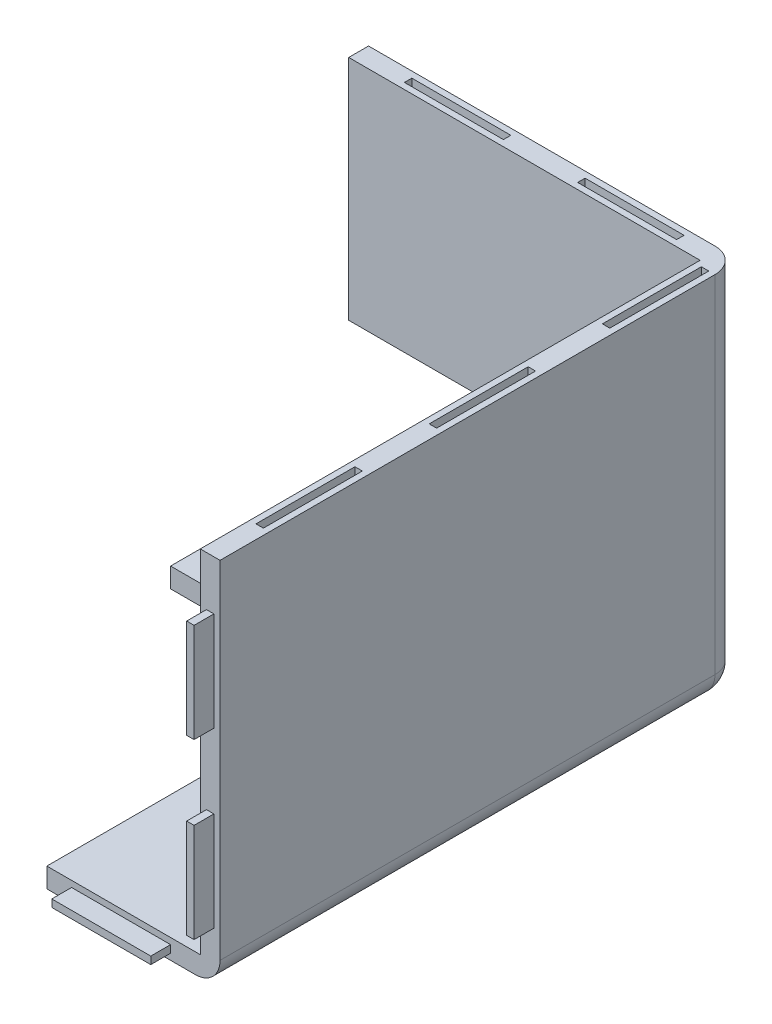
ISO-10303-21;
HEADER;
FILE_DESCRIPTION(('STEP AP214'),'2;1');
FILE_NAME('part.step','',(''),(''),'','','');
FILE_SCHEMA(('AUTOMOTIVE_DESIGN { 1 0 10303 214 1 1 1 1 }'));
ENDSEC;
DATA;
#1=APPLICATION_CONTEXT('core data for automotive mechanical design processes');
#2=APPLICATION_PROTOCOL_DEFINITION('international standard','automotive_design',2000,#1);
#3=PRODUCT_CONTEXT('',#1,'mechanical');
#4=PRODUCT('Part','Part','',(#3));
#5=PRODUCT_RELATED_PRODUCT_CATEGORY('part','',(#4));
#6=PRODUCT_DEFINITION_FORMATION('','',#4);
#7=PRODUCT_DEFINITION_CONTEXT('part definition',#1,'design');
#8=PRODUCT_DEFINITION('design','',#6,#7);
#9=PRODUCT_DEFINITION_SHAPE('','',#8);
#10=(LENGTH_UNIT() NAMED_UNIT(*) SI_UNIT(.MILLI.,.METRE.));
#11=(NAMED_UNIT(*) PLANE_ANGLE_UNIT() SI_UNIT($,.RADIAN.));
#12=(NAMED_UNIT(*) SI_UNIT($,.STERADIAN.) SOLID_ANGLE_UNIT());
#13=UNCERTAINTY_MEASURE_WITH_UNIT(LENGTH_MEASURE(1.E-05),#10,'distance_accuracy_value','');
#14=(GEOMETRIC_REPRESENTATION_CONTEXT(3) GLOBAL_UNCERTAINTY_ASSIGNED_CONTEXT((#13)) GLOBAL_UNIT_ASSIGNED_CONTEXT((#10,
#11,#12)) REPRESENTATION_CONTEXT('',''));
#15=CARTESIAN_POINT('',(0.,0.,0.));
#16=DIRECTION('',(0.,0.,1.));
#17=DIRECTION('',(1.,0.,0.));
#18=AXIS2_PLACEMENT_3D('',#15,#16,#17);
#19=CARTESIAN_POINT('',(0.,150.,0.));
#20=DIRECTION('',(1.,0.,0.));
#21=DIRECTION('',(0.,0.,-1.));
#22=AXIS2_PLACEMENT_3D('',#19,#20,#21);
#23=PLANE('',#22);
#24=DIRECTION('',(0.,0.,1.));
#25=VECTOR('',#24,1.);
#26=CARTESIAN_POINT('',(0.,90.,-207.5));
#27=LINE('',#26,#25);
#28=CARTESIAN_POINT('',(0.,90.,-207.5));
#29=VERTEX_POINT('',#28);
#30=CARTESIAN_POINT('',(0.,90.,-204.5));
#31=VERTEX_POINT('',#30);
#32=EDGE_CURVE('E921',#29,#31,#27,.T.);
#33=ORIENTED_EDGE('',*,*,#32,.F.);
#34=DIRECTION('',(0.,-1.,0.));
#35=VECTOR('',#34,1.);
#36=CARTESIAN_POINT('',(0.,130.,-207.5));
#37=LINE('',#36,#35);
#38=CARTESIAN_POINT('',(0.,130.,-207.5));
#39=VERTEX_POINT('',#38);
#40=EDGE_CURVE('E919',#39,#29,#37,.T.);
#41=ORIENTED_EDGE('',*,*,#40,.F.);
#42=DIRECTION('',(0.,0.,-1.));
#43=VECTOR('',#42,1.);
#44=CARTESIAN_POINT('',(0.,130.,-207.5));
#45=LINE('',#44,#43);
#46=CARTESIAN_POINT('',(0.,130.,-204.5));
#47=VERTEX_POINT('',#46);
#48=EDGE_CURVE('E909',#47,#39,#45,.T.);
#49=ORIENTED_EDGE('',*,*,#48,.F.);
#50=DIRECTION('',(0.,1.,0.));
#51=VECTOR('',#50,1.);
#52=CARTESIAN_POINT('',(0.,130.,-204.5));
#53=LINE('',#52,#51);
#54=EDGE_CURVE('E925',#31,#47,#53,.T.);
#55=ORIENTED_EDGE('',*,*,#54,.F.);
#56=EDGE_LOOP('',(#33,#41,#49,#55));
#57=FACE_BOUND('',#56,.T.);
#58=DIRECTION('',(0.,-1.,0.));
#59=VECTOR('',#58,1.);
#60=CARTESIAN_POINT('',(0.,150.,-210.));
#61=LINE('',#60,#59);
#62=CARTESIAN_POINT('',(0.,150.,-210.));
#63=VERTEX_POINT('',#62);
#64=CARTESIAN_POINT('',(0.,58.,-210.));
#65=VERTEX_POINT('',#64);
#66=EDGE_CURVE('E1004',#63,#65,#61,.T.);
#67=ORIENTED_EDGE('',*,*,#66,.T.);
#68=DIRECTION('',(0.,0.,-1.));
#69=VECTOR('',#68,1.);
#70=CARTESIAN_POINT('',(0.,58.,-200.));
#71=LINE('',#70,#69);
#72=CARTESIAN_POINT('',(0.,58.,-202.));
#73=VERTEX_POINT('',#72);
#74=EDGE_CURVE('E625',#73,#65,#71,.T.);
#75=ORIENTED_EDGE('',*,*,#74,.F.);
#76=DIRECTION('',(0.,1.,0.));
#77=VECTOR('',#76,1.);
#78=CARTESIAN_POINT('',(0.,8.00000000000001,-202.));
#79=LINE('',#78,#77);
#80=CARTESIAN_POINT('',(0.,150.,-202.));
#81=VERTEX_POINT('',#80);
#82=EDGE_CURVE('E987',#73,#81,#79,.T.);
#83=ORIENTED_EDGE('',*,*,#82,.T.);
#84=DIRECTION('',(0.,0.,1.));
#85=VECTOR('',#84,1.);
#86=CARTESIAN_POINT('',(0.,150.,0.));
#87=LINE('',#86,#85);
#88=EDGE_CURVE('E993',#63,#81,#87,.T.);
#89=ORIENTED_EDGE('',*,*,#88,.F.);
#90=EDGE_LOOP('',(#67,#75,#83,#89));
#91=FACE_BOUND('',#90,.T.);
#92=ADVANCED_FACE('F45',(#57,#91),#23,.F.);
#93=CARTESIAN_POINT('',(0.,150.,0.));
#94=DIRECTION('',(0.,0.,-1.));
#95=DIRECTION('',(-1.,0.,0.));
#96=AXIS2_PLACEMENT_3D('',#93,#94,#95);
#97=PLANE('',#96);
#98=DIRECTION('',(0.,-1.,0.));
#99=VECTOR('',#98,1.);
#100=CARTESIAN_POINT('',(144.5,130.,0.));
#101=LINE('',#100,#99);
#102=CARTESIAN_POINT('',(144.5,130.,0.));
#103=VERTEX_POINT('',#102);
#104=CARTESIAN_POINT('',(144.5,90.,0.));
#105=VERTEX_POINT('',#104);
#106=EDGE_CURVE('E864',#103,#105,#101,.T.);
#107=ORIENTED_EDGE('',*,*,#106,.F.);
#108=DIRECTION('',(-1.,0.,0.));
#109=VECTOR('',#108,1.);
#110=CARTESIAN_POINT('',(144.5,130.,0.));
#111=LINE('',#110,#109);
#112=CARTESIAN_POINT('',(147.5,130.,0.));
#113=VERTEX_POINT('',#112);
#114=EDGE_CURVE('E876',#113,#103,#111,.T.);
#115=ORIENTED_EDGE('',*,*,#114,.F.);
#116=DIRECTION('',(0.,1.,0.));
#117=VECTOR('',#116,1.);
#118=CARTESIAN_POINT('',(147.5,130.,0.));
#119=LINE('',#118,#117);
#120=CARTESIAN_POINT('',(147.5,90.,0.));
#121=VERTEX_POINT('',#120);
#122=EDGE_CURVE('E888',#121,#113,#119,.T.);
#123=ORIENTED_EDGE('',*,*,#122,.F.);
#124=DIRECTION('',(1.,0.,0.));
#125=VECTOR('',#124,1.);
#126=CARTESIAN_POINT('',(144.5,90.,0.));
#127=LINE('',#126,#125);
#128=EDGE_CURVE('E885',#105,#121,#127,.T.);
#129=ORIENTED_EDGE('',*,*,#128,.F.);
#130=EDGE_LOOP('',(#107,#115,#123,#129));
#131=FACE_BOUND('',#130,.T.);
#132=DIRECTION('',(1.,0.,0.));
#133=VECTOR('',#132,1.);
#134=CARTESIAN_POINT('',(0.,8.00000000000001,0.));
#135=LINE('',#134,#133);
#136=CARTESIAN_POINT('',(80.,8.00000000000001,0.));
#137=VERTEX_POINT('',#136);
#138=CARTESIAN_POINT('',(142.,8.00000000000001,0.));
#139=VERTEX_POINT('',#138);
#140=EDGE_CURVE('E973',#137,#139,#135,.T.);
#141=ORIENTED_EDGE('',*,*,#140,.F.);
#142=DIRECTION('',(0.,-1.,0.));
#143=VECTOR('',#142,1.);
#144=CARTESIAN_POINT('',(80.,150.,0.));
#145=LINE('',#144,#143);
#146=CARTESIAN_POINT('',(80.,0.,0.));
#147=VERTEX_POINT('',#146);
#148=EDGE_CURVE('E800',#137,#147,#145,.T.);
#149=ORIENTED_EDGE('',*,*,#148,.T.);
#150=DIRECTION('',(1.,0.,0.));
#151=VECTOR('',#150,1.);
#152=CARTESIAN_POINT('',(0.,0.,0.));
#153=LINE('',#152,#151);
#154=CARTESIAN_POINT('',(140.,0.,0.));
#155=VERTEX_POINT('',#154);
#156=EDGE_CURVE('E997',#147,#155,#153,.T.);
#157=ORIENTED_EDGE('',*,*,#156,.T.);
#158=CARTESIAN_POINT('',(140.,10.,0.));
#159=DIRECTION('',(0.,0.,-1.));
#160=DIRECTION('',(-1.,0.,0.));
#161=AXIS2_PLACEMENT_3D('',#158,#159,#160);
#162=CIRCLE('',#161,10.);
#163=CARTESIAN_POINT('',(150.,10.,0.));
#164=VERTEX_POINT('',#163);
#165=EDGE_CURVE('E1029',#155,#164,#162,.F.);
#166=ORIENTED_EDGE('',*,*,#165,.T.);
#167=DIRECTION('',(0.,-1.,0.));
#168=VECTOR('',#167,1.);
#169=CARTESIAN_POINT('',(150.,150.,0.));
#170=LINE('',#169,#168);
#171=CARTESIAN_POINT('',(150.,150.,0.));
#172=VERTEX_POINT('',#171);
#173=EDGE_CURVE('E1010',#172,#164,#170,.T.);
#174=ORIENTED_EDGE('',*,*,#173,.F.);
#175=DIRECTION('',(1.,0.,0.));
#176=VECTOR('',#175,1.);
#177=CARTESIAN_POINT('',(0.,150.,0.));
#178=LINE('',#177,#176);
#179=CARTESIAN_POINT('',(142.,150.,0.));
#180=VERTEX_POINT('',#179);
#181=EDGE_CURVE('E996',#180,#172,#178,.T.);
#182=ORIENTED_EDGE('',*,*,#181,.F.);
#183=DIRECTION('',(0.,1.,0.));
#184=VECTOR('',#183,1.);
#185=CARTESIAN_POINT('',(142.,8.00000000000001,0.));
#186=LINE('',#185,#184);
#187=EDGE_CURVE('E982',#139,#180,#186,.T.);
#188=ORIENTED_EDGE('',*,*,#187,.F.);
#189=EDGE_LOOP('',(#141,#149,#157,#166,#174,#182,#188));
#190=FACE_BOUND('',#189,.T.);
#191=DIRECTION('',(0.,-1.,0.));
#192=VECTOR('',#191,1.);
#193=CARTESIAN_POINT('',(144.5,60.,0.));
#194=LINE('',#193,#192);
#195=CARTESIAN_POINT('',(144.5,60.,0.));
#196=VERTEX_POINT('',#195);
#197=CARTESIAN_POINT('',(144.5,20.,0.));
#198=VERTEX_POINT('',#197);
#199=EDGE_CURVE('E861',#196,#198,#194,.T.);
#200=ORIENTED_EDGE('',*,*,#199,.F.);
#201=DIRECTION('',(-1.,0.,0.));
#202=VECTOR('',#201,1.);
#203=CARTESIAN_POINT('',(144.5,60.,0.));
#204=LINE('',#203,#202);
#205=CARTESIAN_POINT('',(147.5,60.,0.));
#206=VERTEX_POINT('',#205);
#207=EDGE_CURVE('E851',#206,#196,#204,.T.);
#208=ORIENTED_EDGE('',*,*,#207,.F.);
#209=DIRECTION('',(0.,1.,0.));
#210=VECTOR('',#209,1.);
#211=CARTESIAN_POINT('',(147.5,60.,0.));
#212=LINE('',#211,#210);
#213=CARTESIAN_POINT('',(147.5,20.,0.));
#214=VERTEX_POINT('',#213);
#215=EDGE_CURVE('E854',#214,#206,#212,.T.);
#216=ORIENTED_EDGE('',*,*,#215,.F.);
#217=DIRECTION('',(1.,0.,0.));
#218=VECTOR('',#217,1.);
#219=CARTESIAN_POINT('',(144.5,20.,0.));
#220=LINE('',#219,#218);
#221=EDGE_CURVE('E858',#198,#214,#220,.T.);
#222=ORIENTED_EDGE('',*,*,#221,.F.);
#223=EDGE_LOOP('',(#200,#208,#216,#222));
#224=FACE_BOUND('',#223,.T.);
#225=DIRECTION('',(0.,-1.,0.));
#226=VECTOR('',#225,1.);
#227=CARTESIAN_POINT('',(90.,5.50000000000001,0.));
#228=LINE('',#227,#226);
#229=CARTESIAN_POINT('',(90.,5.50000000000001,0.));
#230=VERTEX_POINT('',#229);
#231=CARTESIAN_POINT('',(90.,2.5,0.));
#232=VERTEX_POINT('',#231);
#233=EDGE_CURVE('E828',#230,#232,#228,.T.);
#234=ORIENTED_EDGE('',*,*,#233,.F.);
#235=DIRECTION('',(-1.,0.,0.));
#236=VECTOR('',#235,1.);
#237=CARTESIAN_POINT('',(90.,5.50000000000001,0.));
#238=LINE('',#237,#236);
#239=CARTESIAN_POINT('',(130.,5.50000000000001,0.));
#240=VERTEX_POINT('',#239);
#241=EDGE_CURVE('E818',#240,#230,#238,.T.);
#242=ORIENTED_EDGE('',*,*,#241,.F.);
#243=DIRECTION('',(0.,1.,0.));
#244=VECTOR('',#243,1.);
#245=CARTESIAN_POINT('',(130.,5.50000000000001,0.));
#246=LINE('',#245,#244);
#247=CARTESIAN_POINT('',(130.,2.5,0.));
#248=VERTEX_POINT('',#247);
#249=EDGE_CURVE('E821',#248,#240,#246,.T.);
#250=ORIENTED_EDGE('',*,*,#249,.F.);
#251=DIRECTION('',(1.,0.,0.));
#252=VECTOR('',#251,1.);
#253=CARTESIAN_POINT('',(90.,2.50000000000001,0.));
#254=LINE('',#253,#252);
#255=EDGE_CURVE('E825',#232,#248,#254,.T.);
#256=ORIENTED_EDGE('',*,*,#255,.F.);
#257=EDGE_LOOP('',(#234,#242,#250,#256));
#258=FACE_BOUND('',#257,.T.);
#259=ADVANCED_FACE('F1099',(#131,#190,#224,#258),#97,.F.);
#260=DIRECTION('',(0.,0.,1.));
#261=VECTOR('',#260,1.);
#262=CARTESIAN_POINT('',(0.,8.00000000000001,-202.));
#263=LINE('',#262,#261);
#264=CARTESIAN_POINT('',(0.,8.,-209.797958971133));
#265=VERTEX_POINT('',#264);
#266=CARTESIAN_POINT('',(0.,8.00000000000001,-130.));
#267=VERTEX_POINT('',#266);
#268=EDGE_CURVE('E971',#265,#267,#263,.T.);
#269=ORIENTED_EDGE('',*,*,#268,.F.);
#270=CARTESIAN_POINT('',(0.,10.,-200.));
#271=DIRECTION('',(1.,0.,0.));
#272=DIRECTION('',(0.,0.,-1.));
#273=AXIS2_PLACEMENT_3D('',#270,#271,#272);
#274=CIRCLE('',#273,10.);
#275=CARTESIAN_POINT('',(0.,0.,-200.));
#276=VERTEX_POINT('',#275);
#277=EDGE_CURVE('E1018',#265,#276,#274,.F.);
#278=ORIENTED_EDGE('',*,*,#277,.T.);
#279=DIRECTION('',(0.,0.,1.));
#280=VECTOR('',#279,1.);
#281=CARTESIAN_POINT('',(0.,0.,0.));
#282=LINE('',#281,#280);
#283=CARTESIAN_POINT('',(0.,0.,-130.));
#284=VERTEX_POINT('',#283);
#285=EDGE_CURVE('E989',#276,#284,#282,.T.);
#286=ORIENTED_EDGE('',*,*,#285,.T.);
#287=DIRECTION('',(0.,-1.,0.));
#288=VECTOR('',#287,1.);
#289=CARTESIAN_POINT('',(0.,5.5,-130.));
#290=LINE('',#289,#288);
#291=EDGE_CURVE('E922',#267,#284,#290,.T.);
#292=ORIENTED_EDGE('',*,*,#291,.F.);
#293=EDGE_LOOP('',(#269,#278,#286,#292));
#294=FACE_BOUND('',#293,.T.);
#295=DIRECTION('',(0.,0.,-1.));
#296=VECTOR('',#295,1.);
#297=CARTESIAN_POINT('',(0.,5.5,-160.));
#298=LINE('',#297,#296);
#299=CARTESIAN_POINT('',(0.,5.50000000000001,-160.));
#300=VERTEX_POINT('',#299);
#301=CARTESIAN_POINT('',(0.,5.49999999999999,-200.));
#302=VERTEX_POINT('',#301);
#303=EDGE_CURVE('E957',#300,#302,#298,.T.);
#304=ORIENTED_EDGE('',*,*,#303,.F.);
#305=DIRECTION('',(0.,1.,0.));
#306=VECTOR('',#305,1.);
#307=CARTESIAN_POINT('',(0.,5.5,-160.));
#308=LINE('',#307,#306);
#309=CARTESIAN_POINT('',(0.,2.5,-160.));
#310=VERTEX_POINT('',#309);
#311=EDGE_CURVE('E940',#310,#300,#308,.T.);
#312=ORIENTED_EDGE('',*,*,#311,.F.);
#313=DIRECTION('',(0.,0.,1.));
#314=VECTOR('',#313,1.);
#315=CARTESIAN_POINT('',(0.,2.5,-160.));
#316=LINE('',#315,#314);
#317=CARTESIAN_POINT('',(0.,2.49999999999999,-200.));
#318=VERTEX_POINT('',#317);
#319=EDGE_CURVE('E950',#318,#310,#316,.T.);
#320=ORIENTED_EDGE('',*,*,#319,.F.);
#321=DIRECTION('',(0.,-1.,0.));
#322=VECTOR('',#321,1.);
#323=CARTESIAN_POINT('',(0.,5.49999999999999,-200.));
#324=LINE('',#323,#322);
#325=EDGE_CURVE('E953',#302,#318,#324,.T.);
#326=ORIENTED_EDGE('',*,*,#325,.F.);
#327=EDGE_LOOP('',(#304,#312,#320,#326));
#328=FACE_BOUND('',#327,.T.);
#329=ADVANCED_FACE('F1089',(#294,#328),#23,.F.);
#330=CARTESIAN_POINT('',(150.,150.,0.));
#331=DIRECTION('',(-1.,0.,0.));
#332=DIRECTION('',(0.,0.,1.));
#333=AXIS2_PLACEMENT_3D('',#330,#331,#332);
#334=PLANE('',#333);
#335=ORIENTED_EDGE('',*,*,#173,.T.);
#336=DIRECTION('',(0.,0.,-1.));
#337=VECTOR('',#336,1.);
#338=CARTESIAN_POINT('',(150.,10.,-210.));
#339=LINE('',#338,#337);
#340=CARTESIAN_POINT('',(150.,10.,-200.));
#341=VERTEX_POINT('',#340);
#342=EDGE_CURVE('E1027',#164,#341,#339,.T.);
#343=ORIENTED_EDGE('',*,*,#342,.T.);
#344=DIRECTION('',(0.,-1.,0.));
#345=VECTOR('',#344,1.);
#346=CARTESIAN_POINT('',(150.,150.,-200.));
#347=LINE('',#346,#345);
#348=CARTESIAN_POINT('',(150.,150.,-200.));
#349=VERTEX_POINT('',#348);
#350=EDGE_CURVE('E1025',#341,#349,#347,.F.);
#351=ORIENTED_EDGE('',*,*,#350,.T.);
#352=DIRECTION('',(0.,0.,-1.));
#353=VECTOR('',#352,1.);
#354=CARTESIAN_POINT('',(150.,150.,0.));
#355=LINE('',#354,#353);
#356=EDGE_CURVE('E999',#172,#349,#355,.T.);
#357=ORIENTED_EDGE('',*,*,#356,.F.);
#358=EDGE_LOOP('',(#335,#343,#351,#357));
#359=FACE_BOUND('',#358,.T.);
#360=ADVANCED_FACE('F1117',(#359),#334,.F.);
#361=CARTESIAN_POINT('',(0.,150.,-210.));
#362=DIRECTION('',(0.,0.,1.));
#363=DIRECTION('',(1.,0.,0.));
#364=AXIS2_PLACEMENT_3D('',#361,#362,#363);
#365=PLANE('',#364);
#366=DIRECTION('',(1.,0.,0.));
#367=VECTOR('',#366,1.);
#368=CARTESIAN_POINT('',(52.5,28.,-210.));
#369=LINE('',#368,#367);
#370=CARTESIAN_POINT('',(52.5,28.,-210.));
#371=VERTEX_POINT('',#370);
#372=CARTESIAN_POINT('',(55.5,28.,-210.));
#373=VERTEX_POINT('',#372);
#374=EDGE_CURVE('E573',#371,#373,#369,.T.);
#375=ORIENTED_EDGE('',*,*,#374,.F.);
#376=DIRECTION('',(0.,1.,0.));
#377=VECTOR('',#376,1.);
#378=CARTESIAN_POINT('',(52.5,28.,-210.));
#379=LINE('',#378,#377);
#380=CARTESIAN_POINT('',(52.5,13.,-210.));
#381=VERTEX_POINT('',#380);
#382=EDGE_CURVE('E60',#381,#371,#379,.T.);
#383=ORIENTED_EDGE('',*,*,#382,.F.);
#384=DIRECTION('',(-1.,0.,0.));
#385=VECTOR('',#384,1.);
#386=CARTESIAN_POINT('',(52.5,13.,-210.));
#387=LINE('',#386,#385);
#388=CARTESIAN_POINT('',(55.5,13.,-210.));
#389=VERTEX_POINT('',#388);
#390=EDGE_CURVE('E566',#389,#381,#387,.T.);
#391=ORIENTED_EDGE('',*,*,#390,.F.);
#392=DIRECTION('',(0.,-1.,0.));
#393=VECTOR('',#392,1.);
#394=CARTESIAN_POINT('',(55.5,28.,-210.));
#395=LINE('',#394,#393);
#396=EDGE_CURVE('E569',#373,#389,#395,.T.);
#397=ORIENTED_EDGE('',*,*,#396,.F.);
#398=EDGE_LOOP('',(#375,#383,#391,#397));
#399=FACE_BOUND('',#398,.T.);
#400=DIRECTION('',(1.,0.,0.));
#401=VECTOR('',#400,1.);
#402=CARTESIAN_POINT('',(52.5,51.,-210.));
#403=LINE('',#402,#401);
#404=CARTESIAN_POINT('',(52.5,51.,-210.));
#405=VERTEX_POINT('',#404);
#406=CARTESIAN_POINT('',(55.5,51.,-210.));
#407=VERTEX_POINT('',#406);
#408=EDGE_CURVE('E543',#405,#407,#403,.T.);
#409=ORIENTED_EDGE('',*,*,#408,.F.);
#410=DIRECTION('',(0.,1.,0.));
#411=VECTOR('',#410,1.);
#412=CARTESIAN_POINT('',(52.5,51.,-210.));
#413=LINE('',#412,#411);
#414=CARTESIAN_POINT('',(52.5,36.,-210.));
#415=VERTEX_POINT('',#414);
#416=EDGE_CURVE('E68',#415,#405,#413,.T.);
#417=ORIENTED_EDGE('',*,*,#416,.F.);
#418=DIRECTION('',(-1.,0.,0.));
#419=VECTOR('',#418,1.);
#420=CARTESIAN_POINT('',(52.5,36.,-210.));
#421=LINE('',#420,#419);
#422=CARTESIAN_POINT('',(55.5,36.,-210.));
#423=VERTEX_POINT('',#422);
#424=EDGE_CURVE('E536',#423,#415,#421,.T.);
#425=ORIENTED_EDGE('',*,*,#424,.F.);
#426=DIRECTION('',(0.,-1.,0.));
#427=VECTOR('',#426,1.);
#428=CARTESIAN_POINT('',(55.5,51.,-210.));
#429=LINE('',#428,#427);
#430=EDGE_CURVE('E539',#407,#423,#429,.T.);
#431=ORIENTED_EDGE('',*,*,#430,.F.);
#432=EDGE_LOOP('',(#409,#417,#425,#431));
#433=FACE_BOUND('',#432,.T.);
#434=DIRECTION('',(-1.,0.,0.));
#435=VECTOR('',#434,1.);
#436=CARTESIAN_POINT('',(20.,60.5,-210.));
#437=LINE('',#436,#435);
#438=CARTESIAN_POINT('',(20.,60.5,-210.));
#439=VERTEX_POINT('',#438);
#440=CARTESIAN_POINT('',(5.,60.5,-210.));
#441=VERTEX_POINT('',#440);
#442=EDGE_CURVE('E509',#439,#441,#437,.T.);
#443=ORIENTED_EDGE('',*,*,#442,.F.);
#444=DIRECTION('',(0.,-1.,0.));
#445=VECTOR('',#444,1.);
#446=CARTESIAN_POINT('',(20.,63.5,-210.));
#447=LINE('',#446,#445);
#448=CARTESIAN_POINT('',(20.,63.5,-210.));
#449=VERTEX_POINT('',#448);
#450=EDGE_CURVE('E488',#449,#439,#447,.T.);
#451=ORIENTED_EDGE('',*,*,#450,.F.);
#452=DIRECTION('',(1.,0.,0.));
#453=VECTOR('',#452,1.);
#454=CARTESIAN_POINT('',(20.,63.5,-210.));
#455=LINE('',#454,#453);
#456=CARTESIAN_POINT('',(5.,63.5,-210.));
#457=VERTEX_POINT('',#456);
#458=EDGE_CURVE('E498',#457,#449,#455,.T.);
#459=ORIENTED_EDGE('',*,*,#458,.F.);
#460=DIRECTION('',(0.,1.,0.));
#461=VECTOR('',#460,1.);
#462=CARTESIAN_POINT('',(5.,63.5,-210.));
#463=LINE('',#462,#461);
#464=EDGE_CURVE('E503',#441,#457,#463,.T.);
#465=ORIENTED_EDGE('',*,*,#464,.F.);
#466=EDGE_LOOP('',(#443,#451,#459,#465));
#467=FACE_BOUND('',#466,.T.);
#468=DIRECTION('',(-1.,0.,0.));
#469=VECTOR('',#468,1.);
#470=CARTESIAN_POINT('',(43.,60.5,-210.));
#471=LINE('',#470,#469);
#472=CARTESIAN_POINT('',(43.,60.5,-210.));
#473=VERTEX_POINT('',#472);
#474=CARTESIAN_POINT('',(28.,60.5,-210.));
#475=VERTEX_POINT('',#474);
#476=EDGE_CURVE('E512',#473,#475,#471,.T.);
#477=ORIENTED_EDGE('',*,*,#476,.F.);
#478=DIRECTION('',(0.,-1.,0.));
#479=VECTOR('',#478,1.);
#480=CARTESIAN_POINT('',(43.,63.5,-210.));
#481=LINE('',#480,#479);
#482=CARTESIAN_POINT('',(43.,63.5,-210.));
#483=VERTEX_POINT('',#482);
#484=EDGE_CURVE('E510',#483,#473,#481,.T.);
#485=ORIENTED_EDGE('',*,*,#484,.F.);
#486=DIRECTION('',(1.,0.,0.));
#487=VECTOR('',#486,1.);
#488=CARTESIAN_POINT('',(43.,63.5,-210.));
#489=LINE('',#488,#487);
#490=CARTESIAN_POINT('',(28.,63.5,-210.));
#491=VERTEX_POINT('',#490);
#492=EDGE_CURVE('E591',#491,#483,#489,.T.);
#493=ORIENTED_EDGE('',*,*,#492,.F.);
#494=DIRECTION('',(0.,1.,0.));
#495=VECTOR('',#494,1.);
#496=CARTESIAN_POINT('',(28.,63.5,-210.));
#497=LINE('',#496,#495);
#498=EDGE_CURVE('E603',#475,#491,#497,.T.);
#499=ORIENTED_EDGE('',*,*,#498,.F.);
#500=EDGE_LOOP('',(#477,#485,#493,#499));
#501=FACE_BOUND('',#500,.T.);
#502=DIRECTION('',(-1.,0.,0.));
#503=VECTOR('',#502,1.);
#504=CARTESIAN_POINT('',(0.,10.,-210.));
#505=LINE('',#504,#503);
#506=CARTESIAN_POINT('',(140.,10.,-210.));
#507=VERTEX_POINT('',#506);
#508=CARTESIAN_POINT('',(50.,10.,-210.));
#509=VERTEX_POINT('',#508);
#510=EDGE_CURVE('E1015',#507,#509,#505,.T.);
#511=ORIENTED_EDGE('',*,*,#510,.T.);
#512=DIRECTION('',(0.,-1.,0.));
#513=VECTOR('',#512,1.);
#514=CARTESIAN_POINT('',(50.,58.,-210.));
#515=LINE('',#514,#513);
#516=CARTESIAN_POINT('',(50.,58.,-210.));
#517=VERTEX_POINT('',#516);
#518=EDGE_CURVE('E610',#517,#509,#515,.T.);
#519=ORIENTED_EDGE('',*,*,#518,.F.);
#520=DIRECTION('',(1.,0.,0.));
#521=VECTOR('',#520,1.);
#522=CARTESIAN_POINT('',(50.,58.,-210.));
#523=LINE('',#522,#521);
#524=EDGE_CURVE('E618',#65,#517,#523,.T.);
#525=ORIENTED_EDGE('',*,*,#524,.F.);
#526=ORIENTED_EDGE('',*,*,#66,.F.);
#527=DIRECTION('',(-1.,0.,0.));
#528=VECTOR('',#527,1.);
#529=CARTESIAN_POINT('',(0.,150.,-210.));
#530=LINE('',#529,#528);
#531=CARTESIAN_POINT('',(140.,150.,-210.));
#532=VERTEX_POINT('',#531);
#533=EDGE_CURVE('E1002',#532,#63,#530,.T.);
#534=ORIENTED_EDGE('',*,*,#533,.F.);
#535=DIRECTION('',(0.,-1.,0.));
#536=VECTOR('',#535,1.);
#537=CARTESIAN_POINT('',(140.,150.,-210.));
#538=LINE('',#537,#536);
#539=EDGE_CURVE('E1013',#532,#507,#538,.T.);
#540=ORIENTED_EDGE('',*,*,#539,.T.);
#541=EDGE_LOOP('',(#511,#519,#525,#526,#534,#540));
#542=FACE_BOUND('',#541,.T.);
#543=ADVANCED_FACE('F506',(#399,#433,#467,#501,#542),#365,.F.);
#544=CARTESIAN_POINT('',(0.,150.,0.));
#545=DIRECTION('',(0.,-1.,0.));
#546=DIRECTION('',(0.,0.,-1.));
#547=AXIS2_PLACEMENT_3D('',#544,#545,#546);
#548=PLANE('',#547);
#549=DIRECTION('',(1.,0.,0.));
#550=VECTOR('',#549,1.);
#551=CARTESIAN_POINT('',(20.,150.,-204.5));
#552=LINE('',#551,#550);
#553=CARTESIAN_POINT('',(20.,150.,-204.5));
#554=VERTEX_POINT('',#553);
#555=CARTESIAN_POINT('',(60.,150.,-204.5));
#556=VERTEX_POINT('',#555);
#557=EDGE_CURVE('E647',#554,#556,#552,.T.);
#558=ORIENTED_EDGE('',*,*,#557,.F.);
#559=DIRECTION('',(0.,0.,1.));
#560=VECTOR('',#559,1.);
#561=CARTESIAN_POINT('',(20.,150.,-207.5));
#562=LINE('',#561,#560);
#563=CARTESIAN_POINT('',(20.,150.,-207.5));
#564=VERTEX_POINT('',#563);
#565=EDGE_CURVE('E645',#564,#554,#562,.T.);
#566=ORIENTED_EDGE('',*,*,#565,.F.);
#567=DIRECTION('',(-1.,0.,0.));
#568=VECTOR('',#567,1.);
#569=CARTESIAN_POINT('',(20.,150.,-207.5));
#570=LINE('',#569,#568);
#571=CARTESIAN_POINT('',(60.,150.,-207.5));
#572=VERTEX_POINT('',#571);
#573=EDGE_CURVE('E635',#572,#564,#570,.T.);
#574=ORIENTED_EDGE('',*,*,#573,.F.);
#575=DIRECTION('',(0.,0.,-1.));
#576=VECTOR('',#575,1.);
#577=CARTESIAN_POINT('',(60.,150.,-207.5));
#578=LINE('',#577,#576);
#579=EDGE_CURVE('E651',#556,#572,#578,.T.);
#580=ORIENTED_EDGE('',*,*,#579,.F.);
#581=EDGE_LOOP('',(#558,#566,#574,#580));
#582=FACE_BOUND('',#581,.T.);
#583=DIRECTION('',(1.,0.,0.));
#584=VECTOR('',#583,1.);
#585=CARTESIAN_POINT('',(144.5,150.,-160.));
#586=LINE('',#585,#584);
#587=CARTESIAN_POINT('',(144.5,150.,-160.));
#588=VERTEX_POINT('',#587);
#589=CARTESIAN_POINT('',(147.5,150.,-160.));
#590=VERTEX_POINT('',#589);
#591=EDGE_CURVE('E715',#588,#590,#586,.T.);
#592=ORIENTED_EDGE('',*,*,#591,.F.);
#593=DIRECTION('',(0.,0.,1.));
#594=VECTOR('',#593,1.);
#595=CARTESIAN_POINT('',(144.5,150.,-160.));
#596=LINE('',#595,#594);
#597=CARTESIAN_POINT('',(144.5,150.,-200.));
#598=VERTEX_POINT('',#597);
#599=EDGE_CURVE('E675',#598,#588,#596,.T.);
#600=ORIENTED_EDGE('',*,*,#599,.F.);
#601=DIRECTION('',(-1.,0.,0.));
#602=VECTOR('',#601,1.);
#603=CARTESIAN_POINT('',(144.5,150.,-200.));
#604=LINE('',#603,#602);
#605=CARTESIAN_POINT('',(147.5,150.,-200.));
#606=VERTEX_POINT('',#605);
#607=EDGE_CURVE('E708',#606,#598,#604,.T.);
#608=ORIENTED_EDGE('',*,*,#607,.F.);
#609=DIRECTION('',(0.,0.,-1.));
#610=VECTOR('',#609,1.);
#611=CARTESIAN_POINT('',(147.5,150.,-160.));
#612=LINE('',#611,#610);
#613=EDGE_CURVE('E711',#590,#606,#612,.T.);
#614=ORIENTED_EDGE('',*,*,#613,.F.);
#615=EDGE_LOOP('',(#592,#600,#608,#614));
#616=FACE_BOUND('',#615,.T.);
#617=DIRECTION('',(1.,0.,0.));
#618=VECTOR('',#617,1.);
#619=CARTESIAN_POINT('',(144.5,150.,-90.));
#620=LINE('',#619,#618);
#621=CARTESIAN_POINT('',(144.5,150.,-90.));
#622=VERTEX_POINT('',#621);
#623=CARTESIAN_POINT('',(147.5,150.,-90.));
#624=VERTEX_POINT('',#623);
#625=EDGE_CURVE('E683',#622,#624,#620,.T.);
#626=ORIENTED_EDGE('',*,*,#625,.F.);
#627=DIRECTION('',(0.,0.,1.));
#628=VECTOR('',#627,1.);
#629=CARTESIAN_POINT('',(144.5,150.,-90.));
#630=LINE('',#629,#628);
#631=CARTESIAN_POINT('',(144.5,150.,-130.));
#632=VERTEX_POINT('',#631);
#633=EDGE_CURVE('E686',#632,#622,#630,.T.);
#634=ORIENTED_EDGE('',*,*,#633,.F.);
#635=DIRECTION('',(-1.,0.,0.));
#636=VECTOR('',#635,1.);
#637=CARTESIAN_POINT('',(144.5,150.,-130.));
#638=LINE('',#637,#636);
#639=CARTESIAN_POINT('',(147.5,150.,-130.));
#640=VERTEX_POINT('',#639);
#641=EDGE_CURVE('E676',#640,#632,#638,.T.);
#642=ORIENTED_EDGE('',*,*,#641,.F.);
#643=DIRECTION('',(0.,0.,-1.));
#644=VECTOR('',#643,1.);
#645=CARTESIAN_POINT('',(147.5,150.,-90.));
#646=LINE('',#645,#644);
#647=EDGE_CURVE('E679',#624,#640,#646,.T.);
#648=ORIENTED_EDGE('',*,*,#647,.F.);
#649=EDGE_LOOP('',(#626,#634,#642,#648));
#650=FACE_BOUND('',#649,.T.);
#651=DIRECTION('',(1.,0.,0.));
#652=VECTOR('',#651,1.);
#653=CARTESIAN_POINT('',(144.5,150.,-20.));
#654=LINE('',#653,#652);
#655=CARTESIAN_POINT('',(144.5,150.,-20.));
#656=VERTEX_POINT('',#655);
#657=CARTESIAN_POINT('',(147.5,150.,-20.));
#658=VERTEX_POINT('',#657);
#659=EDGE_CURVE('E777',#656,#658,#654,.T.);
#660=ORIENTED_EDGE('',*,*,#659,.F.);
#661=DIRECTION('',(0.,0.,1.));
#662=VECTOR('',#661,1.);
#663=CARTESIAN_POINT('',(144.5,150.,-20.));
#664=LINE('',#663,#662);
#665=CARTESIAN_POINT('',(144.5,150.,-60.));
#666=VERTEX_POINT('',#665);
#667=EDGE_CURVE('E739',#666,#656,#664,.T.);
#668=ORIENTED_EDGE('',*,*,#667,.F.);
#669=DIRECTION('',(-1.,0.,0.));
#670=VECTOR('',#669,1.);
#671=CARTESIAN_POINT('',(144.5,150.,-60.));
#672=LINE('',#671,#670);
#673=CARTESIAN_POINT('',(147.5,150.,-60.));
#674=VERTEX_POINT('',#673);
#675=EDGE_CURVE('E770',#674,#666,#672,.T.);
#676=ORIENTED_EDGE('',*,*,#675,.F.);
#677=DIRECTION('',(0.,0.,-1.));
#678=VECTOR('',#677,1.);
#679=CARTESIAN_POINT('',(147.5,150.,-20.));
#680=LINE('',#679,#678);
#681=EDGE_CURVE('E773',#658,#674,#680,.T.);
#682=ORIENTED_EDGE('',*,*,#681,.F.);
#683=EDGE_LOOP('',(#660,#668,#676,#682));
#684=FACE_BOUND('',#683,.T.);
#685=DIRECTION('',(1.,0.,0.));
#686=VECTOR('',#685,1.);
#687=CARTESIAN_POINT('',(90.,150.,-204.5));
#688=LINE('',#687,#686);
#689=CARTESIAN_POINT('',(90.,150.,-204.5));
#690=VERTEX_POINT('',#689);
#691=CARTESIAN_POINT('',(130.,150.,-204.5));
#692=VERTEX_POINT('',#691);
#693=EDGE_CURVE('E747',#690,#692,#688,.T.);
#694=ORIENTED_EDGE('',*,*,#693,.F.);
#695=DIRECTION('',(0.,0.,1.));
#696=VECTOR('',#695,1.);
#697=CARTESIAN_POINT('',(90.,150.,-207.5));
#698=LINE('',#697,#696);
#699=CARTESIAN_POINT('',(90.,150.,-207.5));
#700=VERTEX_POINT('',#699);
#701=EDGE_CURVE('E648',#700,#690,#698,.T.);
#702=ORIENTED_EDGE('',*,*,#701,.F.);
#703=DIRECTION('',(-1.,0.,0.));
#704=VECTOR('',#703,1.);
#705=CARTESIAN_POINT('',(90.,150.,-207.5));
#706=LINE('',#705,#704);
#707=CARTESIAN_POINT('',(130.,150.,-207.5));
#708=VERTEX_POINT('',#707);
#709=EDGE_CURVE('E740',#708,#700,#706,.T.);
#710=ORIENTED_EDGE('',*,*,#709,.F.);
#711=DIRECTION('',(0.,0.,-1.));
#712=VECTOR('',#711,1.);
#713=CARTESIAN_POINT('',(130.,150.,-207.5));
#714=LINE('',#713,#712);
#715=EDGE_CURVE('E743',#692,#708,#714,.T.);
#716=ORIENTED_EDGE('',*,*,#715,.F.);
#717=EDGE_LOOP('',(#694,#702,#710,#716));
#718=FACE_BOUND('',#717,.T.);
#719=ORIENTED_EDGE('',*,*,#356,.T.);
#720=CARTESIAN_POINT('',(140.,150.,-200.));
#721=DIRECTION('',(0.,-1.,0.));
#722=DIRECTION('',(0.,0.,-1.));
#723=AXIS2_PLACEMENT_3D('',#720,#721,#722);
#724=CIRCLE('',#723,10.);
#725=EDGE_CURVE('E1031',#349,#532,#724,.F.);
#726=ORIENTED_EDGE('',*,*,#725,.T.);
#727=ORIENTED_EDGE('',*,*,#533,.T.);
#728=ORIENTED_EDGE('',*,*,#88,.T.);
#729=DIRECTION('',(-1.,0.,0.));
#730=VECTOR('',#729,1.);
#731=CARTESIAN_POINT('',(0.,150.,-202.));
#732=LINE('',#731,#730);
#733=CARTESIAN_POINT('',(142.,150.,-202.));
#734=VERTEX_POINT('',#733);
#735=EDGE_CURVE('E974',#734,#81,#732,.T.);
#736=ORIENTED_EDGE('',*,*,#735,.F.);
#737=DIRECTION('',(0.,0.,-1.));
#738=VECTOR('',#737,1.);
#739=CARTESIAN_POINT('',(142.,150.,-202.));
#740=LINE('',#739,#738);
#741=EDGE_CURVE('E932',#180,#734,#740,.T.);
#742=ORIENTED_EDGE('',*,*,#741,.F.);
#743=ORIENTED_EDGE('',*,*,#181,.T.);
#744=EDGE_LOOP('',(#719,#726,#727,#728,#736,#742,#743));
#745=FACE_BOUND('',#744,.T.);
#746=ADVANCED_FACE('F1108',(#582,#616,#650,#684,#718,#745),#548,.F.);
#747=CARTESIAN_POINT('',(0.,0.,0.));
#748=DIRECTION('',(0.,-1.,0.));
#749=DIRECTION('',(0.,0.,-1.));
#750=AXIS2_PLACEMENT_3D('',#747,#748,#749);
#751=PLANE('',#750);
#752=DIRECTION('',(0.,0.,1.));
#753=VECTOR('',#752,1.);
#754=CARTESIAN_POINT('',(80.,0.,8.));
#755=LINE('',#754,#753);
#756=CARTESIAN_POINT('',(80.,0.,-130.));
#757=VERTEX_POINT('',#756);
#758=EDGE_CURVE('E793',#757,#147,#755,.T.);
#759=ORIENTED_EDGE('',*,*,#758,.F.);
#760=DIRECTION('',(1.,0.,0.));
#761=VECTOR('',#760,1.);
#762=CARTESIAN_POINT('',(0.,0.,-130.));
#763=LINE('',#762,#761);
#764=EDGE_CURVE('E658',#284,#757,#763,.T.);
#765=ORIENTED_EDGE('',*,*,#764,.F.);
#766=ORIENTED_EDGE('',*,*,#285,.F.);
#767=DIRECTION('',(-1.,0.,0.));
#768=VECTOR('',#767,1.);
#769=CARTESIAN_POINT('',(150.,0.,-200.));
#770=LINE('',#769,#768);
#771=CARTESIAN_POINT('',(140.,0.,-200.));
#772=VERTEX_POINT('',#771);
#773=EDGE_CURVE('E1023',#276,#772,#770,.F.);
#774=ORIENTED_EDGE('',*,*,#773,.T.);
#775=DIRECTION('',(0.,0.,-1.));
#776=VECTOR('',#775,1.);
#777=CARTESIAN_POINT('',(140.,0.,0.));
#778=LINE('',#777,#776);
#779=EDGE_CURVE('E1020',#772,#155,#778,.F.);
#780=ORIENTED_EDGE('',*,*,#779,.T.);
#781=ORIENTED_EDGE('',*,*,#156,.F.);
#782=EDGE_LOOP('',(#759,#765,#766,#774,#780,#781));
#783=FACE_BOUND('',#782,.T.);
#784=ADVANCED_FACE('F1085',(#783),#751,.T.);
#785=CARTESIAN_POINT('',(0.,8.00000000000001,-202.));
#786=DIRECTION('',(0.,0.,-1.));
#787=DIRECTION('',(-1.,0.,0.));
#788=AXIS2_PLACEMENT_3D('',#785,#786,#787);
#789=PLANE('',#788);
#790=DIRECTION('',(1.,0.,0.));
#791=VECTOR('',#790,1.);
#792=CARTESIAN_POINT('',(0.,58.,-202.));
#793=LINE('',#792,#791);
#794=CARTESIAN_POINT('',(50.,58.,-202.));
#795=VERTEX_POINT('',#794);
#796=EDGE_CURVE('E11',#73,#795,#793,.T.);
#797=ORIENTED_EDGE('',*,*,#796,.T.);
#798=DIRECTION('',(0.,-1.,0.));
#799=VECTOR('',#798,1.);
#800=CARTESIAN_POINT('',(50.,8.,-202.));
#801=LINE('',#800,#799);
#802=CARTESIAN_POINT('',(50.,8.,-202.));
#803=VERTEX_POINT('',#802);
#804=EDGE_CURVE('E624',#795,#803,#801,.T.);
#805=ORIENTED_EDGE('',*,*,#804,.T.);
#806=DIRECTION('',(-1.,0.,0.));
#807=VECTOR('',#806,1.);
#808=CARTESIAN_POINT('',(0.,8.00000000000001,-202.));
#809=LINE('',#808,#807);
#810=CARTESIAN_POINT('',(142.,8.00000000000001,-202.));
#811=VERTEX_POINT('',#810);
#812=EDGE_CURVE('E979',#811,#803,#809,.T.);
#813=ORIENTED_EDGE('',*,*,#812,.F.);
#814=DIRECTION('',(0.,1.,0.));
#815=VECTOR('',#814,1.);
#816=CARTESIAN_POINT('',(142.,8.00000000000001,-202.));
#817=LINE('',#816,#815);
#818=EDGE_CURVE('E990',#811,#734,#817,.T.);
#819=ORIENTED_EDGE('',*,*,#818,.T.);
#820=ORIENTED_EDGE('',*,*,#735,.T.);
#821=ORIENTED_EDGE('',*,*,#82,.F.);
#822=EDGE_LOOP('',(#797,#805,#813,#819,#820,#821));
#823=FACE_BOUND('',#822,.T.);
#824=ADVANCED_FACE('F1062',(#823),#789,.F.);
#825=CARTESIAN_POINT('',(142.,8.00000000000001,-202.));
#826=DIRECTION('',(1.,0.,0.));
#827=DIRECTION('',(0.,0.,-1.));
#828=AXIS2_PLACEMENT_3D('',#825,#826,#827);
#829=PLANE('',#828);
#830=ORIENTED_EDGE('',*,*,#741,.T.);
#831=ORIENTED_EDGE('',*,*,#818,.F.);
#832=DIRECTION('',(0.,0.,-1.));
#833=VECTOR('',#832,1.);
#834=CARTESIAN_POINT('',(142.,8.00000000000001,-202.));
#835=LINE('',#834,#833);
#836=EDGE_CURVE('E976',#139,#811,#835,.T.);
#837=ORIENTED_EDGE('',*,*,#836,.F.);
#838=ORIENTED_EDGE('',*,*,#187,.T.);
#839=EDGE_LOOP('',(#830,#831,#837,#838));
#840=FACE_BOUND('',#839,.T.);
#841=ADVANCED_FACE('F1105',(#840),#829,.F.);
#842=CARTESIAN_POINT('',(0.,8.00000000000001,0.));
#843=DIRECTION('',(0.,1.,0.));
#844=DIRECTION('',(0.,0.,1.));
#845=AXIS2_PLACEMENT_3D('',#842,#843,#844);
#846=PLANE('',#845);
#847=ORIENTED_EDGE('',*,*,#812,.T.);
#848=DIRECTION('',(0.,0.,-1.));
#849=VECTOR('',#848,1.);
#850=CARTESIAN_POINT('',(50.,8.,-200.));
#851=LINE('',#850,#849);
#852=CARTESIAN_POINT('',(50.,8.,-209.797958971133));
#853=VERTEX_POINT('',#852);
#854=EDGE_CURVE('E621',#803,#853,#851,.T.);
#855=ORIENTED_EDGE('',*,*,#854,.T.);
#856=DIRECTION('',(1.,0.,0.));
#857=VECTOR('',#856,1.);
#858=CARTESIAN_POINT('',(0.,8.,-209.797958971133));
#859=LINE('',#858,#857);
#860=EDGE_CURVE('E1042',#853,#265,#859,.F.);
#861=ORIENTED_EDGE('',*,*,#860,.T.);
#862=ORIENTED_EDGE('',*,*,#268,.T.);
#863=DIRECTION('',(-1.,0.,0.));
#864=VECTOR('',#863,1.);
#865=CARTESIAN_POINT('',(0.,8.00000000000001,-130.));
#866=LINE('',#865,#864);
#867=CARTESIAN_POINT('',(80.,8.00000000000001,-130.));
#868=VERTEX_POINT('',#867);
#869=EDGE_CURVE('E797',#868,#267,#866,.T.);
#870=ORIENTED_EDGE('',*,*,#869,.F.);
#871=DIRECTION('',(0.,0.,-1.));
#872=VECTOR('',#871,1.);
#873=CARTESIAN_POINT('',(80.,8.00000000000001,0.));
#874=LINE('',#873,#872);
#875=EDGE_CURVE('E1033',#137,#868,#874,.T.);
#876=ORIENTED_EDGE('',*,*,#875,.F.);
#877=ORIENTED_EDGE('',*,*,#140,.T.);
#878=ORIENTED_EDGE('',*,*,#836,.T.);
#879=EDGE_LOOP('',(#847,#855,#861,#862,#870,#876,#877,#878));
#880=FACE_BOUND('',#879,.T.);
#881=ADVANCED_FACE('F1056',(#880),#846,.T.);
#882=CARTESIAN_POINT('',(8.,5.5,-160.));
#883=DIRECTION('',(0.,0.,1.));
#884=DIRECTION('',(1.,0.,0.));
#885=AXIS2_PLACEMENT_3D('',#882,#883,#884);
#886=PLANE('',#885);
#887=ORIENTED_EDGE('',*,*,#311,.T.);
#888=DIRECTION('',(-1.,0.,0.));
#889=VECTOR('',#888,1.);
#890=CARTESIAN_POINT('',(8.,5.5,-160.));
#891=LINE('',#890,#889);
#892=CARTESIAN_POINT('',(8.,5.5,-160.));
#893=VERTEX_POINT('',#892);
#894=EDGE_CURVE('E941',#893,#300,#891,.T.);
#895=ORIENTED_EDGE('',*,*,#894,.F.);
#896=DIRECTION('',(0.,1.,0.));
#897=VECTOR('',#896,1.);
#898=CARTESIAN_POINT('',(8.,5.5,-160.));
#899=LINE('',#898,#897);
#900=CARTESIAN_POINT('',(8.,2.5,-160.));
#901=VERTEX_POINT('',#900);
#902=EDGE_CURVE('E954',#901,#893,#899,.T.);
#903=ORIENTED_EDGE('',*,*,#902,.F.);
#904=DIRECTION('',(-1.,0.,0.));
#905=VECTOR('',#904,1.);
#906=CARTESIAN_POINT('',(8.,2.5,-160.));
#907=LINE('',#906,#905);
#908=EDGE_CURVE('E904',#901,#310,#907,.T.);
#909=ORIENTED_EDGE('',*,*,#908,.T.);
#910=EDGE_LOOP('',(#887,#895,#903,#909));
#911=FACE_BOUND('',#910,.T.);
#912=ADVANCED_FACE('F1224',(#911),#886,.F.);
#913=CARTESIAN_POINT('',(8.,2.5,-160.));
#914=DIRECTION('',(0.,-1.,0.));
#915=DIRECTION('',(0.,0.,-1.));
#916=AXIS2_PLACEMENT_3D('',#913,#914,#915);
#917=PLANE('',#916);
#918=ORIENTED_EDGE('',*,*,#319,.T.);
#919=ORIENTED_EDGE('',*,*,#908,.F.);
#920=DIRECTION('',(0.,0.,1.));
#921=VECTOR('',#920,1.);
#922=CARTESIAN_POINT('',(8.,2.5,-160.));
#923=LINE('',#922,#921);
#924=CARTESIAN_POINT('',(8.,2.49999999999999,-200.));
#925=VERTEX_POINT('',#924);
#926=EDGE_CURVE('E944',#925,#901,#923,.T.);
#927=ORIENTED_EDGE('',*,*,#926,.F.);
#928=DIRECTION('',(-1.,0.,0.));
#929=VECTOR('',#928,1.);
#930=CARTESIAN_POINT('',(8.,2.49999999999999,-200.));
#931=LINE('',#930,#929);
#932=EDGE_CURVE('E947',#925,#318,#931,.T.);
#933=ORIENTED_EDGE('',*,*,#932,.T.);
#934=EDGE_LOOP('',(#918,#919,#927,#933));
#935=FACE_BOUND('',#934,.T.);
#936=ADVANCED_FACE('F1227',(#935),#917,.F.);
#937=CARTESIAN_POINT('',(8.,5.49999999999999,-200.));
#938=DIRECTION('',(0.,0.,-1.));
#939=DIRECTION('',(-1.,0.,0.));
#940=AXIS2_PLACEMENT_3D('',#937,#938,#939);
#941=PLANE('',#940);
#942=ORIENTED_EDGE('',*,*,#325,.T.);
#943=ORIENTED_EDGE('',*,*,#932,.F.);
#944=DIRECTION('',(0.,-1.,0.));
#945=VECTOR('',#944,1.);
#946=CARTESIAN_POINT('',(8.,5.49999999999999,-200.));
#947=LINE('',#946,#945);
#948=CARTESIAN_POINT('',(8.,5.49999999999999,-200.));
#949=VERTEX_POINT('',#948);
#950=EDGE_CURVE('E963',#949,#925,#947,.T.);
#951=ORIENTED_EDGE('',*,*,#950,.F.);
#952=DIRECTION('',(-1.,0.,0.));
#953=VECTOR('',#952,1.);
#954=CARTESIAN_POINT('',(8.,5.49999999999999,-200.));
#955=LINE('',#954,#953);
#956=EDGE_CURVE('E945',#949,#302,#955,.T.);
#957=ORIENTED_EDGE('',*,*,#956,.T.);
#958=EDGE_LOOP('',(#942,#943,#951,#957));
#959=FACE_BOUND('',#958,.T.);
#960=ADVANCED_FACE('F1232',(#959),#941,.F.);
#961=CARTESIAN_POINT('',(8.,5.5,-160.));
#962=DIRECTION('',(0.,1.,0.));
#963=DIRECTION('',(0.,0.,1.));
#964=AXIS2_PLACEMENT_3D('',#961,#962,#963);
#965=PLANE('',#964);
#966=ORIENTED_EDGE('',*,*,#303,.T.);
#967=ORIENTED_EDGE('',*,*,#956,.F.);
#968=DIRECTION('',(0.,0.,-1.));
#969=VECTOR('',#968,1.);
#970=CARTESIAN_POINT('',(8.,5.5,-160.));
#971=LINE('',#970,#969);
#972=EDGE_CURVE('E966',#893,#949,#971,.T.);
#973=ORIENTED_EDGE('',*,*,#972,.F.);
#974=ORIENTED_EDGE('',*,*,#894,.T.);
#975=EDGE_LOOP('',(#966,#967,#973,#974));
#976=FACE_BOUND('',#975,.T.);
#977=ADVANCED_FACE('F1229',(#976),#965,.F.);
#978=CARTESIAN_POINT('',(8.,0.,0.));
#979=DIRECTION('',(1.,0.,0.));
#980=DIRECTION('',(0.,0.,-1.));
#981=AXIS2_PLACEMENT_3D('',#978,#979,#980);
#982=PLANE('',#981);
#983=ORIENTED_EDGE('',*,*,#902,.T.);
#984=ORIENTED_EDGE('',*,*,#972,.T.);
#985=ORIENTED_EDGE('',*,*,#950,.T.);
#986=ORIENTED_EDGE('',*,*,#926,.T.);
#987=EDGE_LOOP('',(#983,#984,#985,#986));
#988=FACE_BOUND('',#987,.T.);
#989=ADVANCED_FACE('F1223',(#988),#982,.F.);
#990=CARTESIAN_POINT('',(8.,5.5,-130.));
#991=DIRECTION('',(0.,0.,-1.));
#992=DIRECTION('',(-1.,0.,0.));
#993=AXIS2_PLACEMENT_3D('',#990,#991,#992);
#994=PLANE('',#993);
#995=ORIENTED_EDGE('',*,*,#291,.T.);
#996=ORIENTED_EDGE('',*,*,#764,.T.);
#997=DIRECTION('',(0.,-1.,0.));
#998=VECTOR('',#997,1.);
#999=CARTESIAN_POINT('',(80.,10.,-130.));
#1000=LINE('',#999,#998);
#1001=EDGE_CURVE('E795',#868,#757,#1000,.T.);
#1002=ORIENTED_EDGE('',*,*,#1001,.F.);
#1003=ORIENTED_EDGE('',*,*,#869,.T.);
#1004=EDGE_LOOP('',(#995,#996,#1002,#1003));
#1005=FACE_BOUND('',#1004,.T.);
#1006=ADVANCED_FACE('F1093',(#1005),#994,.F.);
#1007=CARTESIAN_POINT('',(8.,130.,-207.5));
#1008=DIRECTION('',(0.,0.,-1.));
#1009=DIRECTION('',(0.,1.,0.));
#1010=AXIS2_PLACEMENT_3D('',#1007,#1008,#1009);
#1011=PLANE('',#1010);
#1012=ORIENTED_EDGE('',*,*,#40,.T.);
#1013=DIRECTION('',(-1.,0.,0.));
#1014=VECTOR('',#1013,1.);
#1015=CARTESIAN_POINT('',(8.,90.,-207.5));
#1016=LINE('',#1015,#1014);
#1017=CARTESIAN_POINT('',(8.,90.,-207.5));
#1018=VERTEX_POINT('',#1017);
#1019=EDGE_CURVE('E918',#1018,#29,#1016,.T.);
#1020=ORIENTED_EDGE('',*,*,#1019,.F.);
#1021=DIRECTION('',(0.,-1.,0.));
#1022=VECTOR('',#1021,1.);
#1023=CARTESIAN_POINT('',(8.,130.,-207.5));
#1024=LINE('',#1023,#1022);
#1025=CARTESIAN_POINT('',(8.,130.,-207.5));
#1026=VERTEX_POINT('',#1025);
#1027=EDGE_CURVE('E905',#1026,#1018,#1024,.T.);
#1028=ORIENTED_EDGE('',*,*,#1027,.F.);
#1029=DIRECTION('',(-1.,0.,0.));
#1030=VECTOR('',#1029,1.);
#1031=CARTESIAN_POINT('',(8.,130.,-207.5));
#1032=LINE('',#1031,#1030);
#1033=EDGE_CURVE('E930',#1026,#39,#1032,.T.);
#1034=ORIENTED_EDGE('',*,*,#1033,.T.);
#1035=EDGE_LOOP('',(#1012,#1020,#1028,#1034));
#1036=FACE_BOUND('',#1035,.T.);
#1037=ADVANCED_FACE('F1210',(#1036),#1011,.F.);
#1038=CARTESIAN_POINT('',(8.,130.,-207.5));
#1039=DIRECTION('',(0.,1.,0.));
#1040=DIRECTION('',(0.,0.,1.));
#1041=AXIS2_PLACEMENT_3D('',#1038,#1039,#1040);
#1042=PLANE('',#1041);
#1043=ORIENTED_EDGE('',*,*,#48,.T.);
#1044=ORIENTED_EDGE('',*,*,#1033,.F.);
#1045=DIRECTION('',(0.,0.,-1.));
#1046=VECTOR('',#1045,1.);
#1047=CARTESIAN_POINT('',(8.,130.,-207.5));
#1048=LINE('',#1047,#1046);
#1049=CARTESIAN_POINT('',(8.,130.,-204.5));
#1050=VERTEX_POINT('',#1049);
#1051=EDGE_CURVE('E915',#1050,#1026,#1048,.T.);
#1052=ORIENTED_EDGE('',*,*,#1051,.F.);
#1053=DIRECTION('',(-1.,0.,0.));
#1054=VECTOR('',#1053,1.);
#1055=CARTESIAN_POINT('',(8.,130.,-204.5));
#1056=LINE('',#1055,#1054);
#1057=EDGE_CURVE('E933',#1050,#47,#1056,.T.);
#1058=ORIENTED_EDGE('',*,*,#1057,.T.);
#1059=EDGE_LOOP('',(#1043,#1044,#1052,#1058));
#1060=FACE_BOUND('',#1059,.T.);
#1061=ADVANCED_FACE('F1206',(#1060),#1042,.F.);
#1062=CARTESIAN_POINT('',(8.,130.,-204.5));
#1063=DIRECTION('',(0.,0.,1.));
#1064=DIRECTION('',(1.,0.,0.));
#1065=AXIS2_PLACEMENT_3D('',#1062,#1063,#1064);
#1066=PLANE('',#1065);
#1067=ORIENTED_EDGE('',*,*,#54,.T.);
#1068=ORIENTED_EDGE('',*,*,#1057,.F.);
#1069=DIRECTION('',(0.,1.,0.));
#1070=VECTOR('',#1069,1.);
#1071=CARTESIAN_POINT('',(8.,130.,-204.5));
#1072=LINE('',#1071,#1070);
#1073=CARTESIAN_POINT('',(8.,90.,-204.5));
#1074=VERTEX_POINT('',#1073);
#1075=EDGE_CURVE('E912',#1074,#1050,#1072,.T.);
#1076=ORIENTED_EDGE('',*,*,#1075,.F.);
#1077=DIRECTION('',(-1.,0.,0.));
#1078=VECTOR('',#1077,1.);
#1079=CARTESIAN_POINT('',(8.,90.,-204.5));
#1080=LINE('',#1079,#1078);
#1081=EDGE_CURVE('E935',#1074,#31,#1080,.T.);
#1082=ORIENTED_EDGE('',*,*,#1081,.T.);
#1083=EDGE_LOOP('',(#1067,#1068,#1076,#1082));
#1084=FACE_BOUND('',#1083,.T.);
#1085=ADVANCED_FACE('F1209',(#1084),#1066,.F.);
#1086=CARTESIAN_POINT('',(8.,90.,-207.5));
#1087=DIRECTION('',(0.,-1.,0.));
#1088=DIRECTION('',(0.,0.,-1.));
#1089=AXIS2_PLACEMENT_3D('',#1086,#1087,#1088);
#1090=PLANE('',#1089);
#1091=ORIENTED_EDGE('',*,*,#32,.T.);
#1092=ORIENTED_EDGE('',*,*,#1081,.F.);
#1093=DIRECTION('',(0.,0.,1.));
#1094=VECTOR('',#1093,1.);
#1095=CARTESIAN_POINT('',(8.,90.,-207.5));
#1096=LINE('',#1095,#1094);
#1097=EDGE_CURVE('E908',#1018,#1074,#1096,.T.);
#1098=ORIENTED_EDGE('',*,*,#1097,.F.);
#1099=ORIENTED_EDGE('',*,*,#1019,.T.);
#1100=EDGE_LOOP('',(#1091,#1092,#1098,#1099));
#1101=FACE_BOUND('',#1100,.T.);
#1102=ADVANCED_FACE('F1204',(#1101),#1090,.F.);
#1103=CARTESIAN_POINT('',(8.,0.,0.));
#1104=DIRECTION('',(-1.,0.,0.));
#1105=DIRECTION('',(0.,0.,1.));
#1106=AXIS2_PLACEMENT_3D('',#1103,#1104,#1105);
#1107=PLANE('',#1106);
#1108=ORIENTED_EDGE('',*,*,#1027,.T.);
#1109=ORIENTED_EDGE('',*,*,#1097,.T.);
#1110=ORIENTED_EDGE('',*,*,#1075,.T.);
#1111=ORIENTED_EDGE('',*,*,#1051,.T.);
#1112=EDGE_LOOP('',(#1108,#1109,#1110,#1111));
#1113=FACE_BOUND('',#1112,.T.);
#1114=ADVANCED_FACE('F1200',(#1113),#1107,.T.);
#1115=CARTESIAN_POINT('',(144.5,130.,8.));
#1116=DIRECTION('',(1.,0.,0.));
#1117=DIRECTION('',(0.,1.,0.));
#1118=AXIS2_PLACEMENT_3D('',#1115,#1116,#1117);
#1119=PLANE('',#1118);
#1120=ORIENTED_EDGE('',*,*,#106,.T.);
#1121=DIRECTION('',(0.,0.,-1.));
#1122=VECTOR('',#1121,1.);
#1123=CARTESIAN_POINT('',(144.5,90.,8.));
#1124=LINE('',#1123,#1122);
#1125=CARTESIAN_POINT('',(144.5,90.,8.));
#1126=VERTEX_POINT('',#1125);
#1127=EDGE_CURVE('E901',#1126,#105,#1124,.T.);
#1128=ORIENTED_EDGE('',*,*,#1127,.F.);
#1129=DIRECTION('',(0.,-1.,0.));
#1130=VECTOR('',#1129,1.);
#1131=CARTESIAN_POINT('',(144.5,130.,8.));
#1132=LINE('',#1131,#1130);
#1133=CARTESIAN_POINT('',(144.5,130.,8.));
#1134=VERTEX_POINT('',#1133);
#1135=EDGE_CURVE('E872',#1134,#1126,#1132,.T.);
#1136=ORIENTED_EDGE('',*,*,#1135,.F.);
#1137=DIRECTION('',(0.,0.,-1.));
#1138=VECTOR('',#1137,1.);
#1139=CARTESIAN_POINT('',(144.5,130.,8.));
#1140=LINE('',#1139,#1138);
#1141=EDGE_CURVE('E882',#1134,#103,#1140,.T.);
#1142=ORIENTED_EDGE('',*,*,#1141,.T.);
#1143=EDGE_LOOP('',(#1120,#1128,#1136,#1142));
#1144=FACE_BOUND('',#1143,.T.);
#1145=ADVANCED_FACE('F1196',(#1144),#1119,.F.);
#1146=CARTESIAN_POINT('',(144.5,90.,8.));
#1147=DIRECTION('',(0.,1.,0.));
#1148=DIRECTION('',(-1.,0.,0.));
#1149=AXIS2_PLACEMENT_3D('',#1146,#1147,#1148);
#1150=PLANE('',#1149);
#1151=ORIENTED_EDGE('',*,*,#128,.T.);
#1152=DIRECTION('',(0.,0.,-1.));
#1153=VECTOR('',#1152,1.);
#1154=CARTESIAN_POINT('',(147.5,90.,8.));
#1155=LINE('',#1154,#1153);
#1156=CARTESIAN_POINT('',(147.5,90.,8.));
#1157=VERTEX_POINT('',#1156);
#1158=EDGE_CURVE('E898',#1157,#121,#1155,.T.);
#1159=ORIENTED_EDGE('',*,*,#1158,.F.);
#1160=DIRECTION('',(1.,0.,0.));
#1161=VECTOR('',#1160,1.);
#1162=CARTESIAN_POINT('',(144.5,90.,8.));
#1163=LINE('',#1162,#1161);
#1164=EDGE_CURVE('E875',#1126,#1157,#1163,.T.);
#1165=ORIENTED_EDGE('',*,*,#1164,.F.);
#1166=ORIENTED_EDGE('',*,*,#1127,.T.);
#1167=EDGE_LOOP('',(#1151,#1159,#1165,#1166));
#1168=FACE_BOUND('',#1167,.T.);
#1169=ADVANCED_FACE('F1192',(#1168),#1150,.F.);
#1170=CARTESIAN_POINT('',(147.5,130.,8.));
#1171=DIRECTION('',(-1.,0.,0.));
#1172=DIRECTION('',(0.,-1.,0.));
#1173=AXIS2_PLACEMENT_3D('',#1170,#1171,#1172);
#1174=PLANE('',#1173);
#1175=ORIENTED_EDGE('',*,*,#122,.T.);
#1176=DIRECTION('',(0.,0.,-1.));
#1177=VECTOR('',#1176,1.);
#1178=CARTESIAN_POINT('',(147.5,130.,8.));
#1179=LINE('',#1178,#1177);
#1180=CARTESIAN_POINT('',(147.5,130.,8.));
#1181=VERTEX_POINT('',#1180);
#1182=EDGE_CURVE('E895',#1181,#113,#1179,.T.);
#1183=ORIENTED_EDGE('',*,*,#1182,.F.);
#1184=DIRECTION('',(0.,1.,0.));
#1185=VECTOR('',#1184,1.);
#1186=CARTESIAN_POINT('',(147.5,130.,8.));
#1187=LINE('',#1186,#1185);
#1188=EDGE_CURVE('E878',#1157,#1181,#1187,.T.);
#1189=ORIENTED_EDGE('',*,*,#1188,.F.);
#1190=ORIENTED_EDGE('',*,*,#1158,.T.);
#1191=EDGE_LOOP('',(#1175,#1183,#1189,#1190));
#1192=FACE_BOUND('',#1191,.T.);
#1193=ADVANCED_FACE('F1188',(#1192),#1174,.F.);
#1194=CARTESIAN_POINT('',(144.5,130.,8.));
#1195=DIRECTION('',(0.,-1.,0.));
#1196=DIRECTION('',(0.,0.,-1.));
#1197=AXIS2_PLACEMENT_3D('',#1194,#1195,#1196);
#1198=PLANE('',#1197);
#1199=ORIENTED_EDGE('',*,*,#114,.T.);
#1200=ORIENTED_EDGE('',*,*,#1141,.F.);
#1201=DIRECTION('',(-1.,0.,0.));
#1202=VECTOR('',#1201,1.);
#1203=CARTESIAN_POINT('',(144.5,130.,8.));
#1204=LINE('',#1203,#1202);
#1205=EDGE_CURVE('E880',#1181,#1134,#1204,.T.);
#1206=ORIENTED_EDGE('',*,*,#1205,.F.);
#1207=ORIENTED_EDGE('',*,*,#1182,.T.);
#1208=EDGE_LOOP('',(#1199,#1200,#1206,#1207));
#1209=FACE_BOUND('',#1208,.T.);
#1210=ADVANCED_FACE('F1184',(#1209),#1198,.F.);
#1211=CARTESIAN_POINT('',(0.,0.,8.));
#1212=DIRECTION('',(0.,0.,1.));
#1213=DIRECTION('',(1.,0.,0.));
#1214=AXIS2_PLACEMENT_3D('',#1211,#1212,#1213);
#1215=PLANE('',#1214);
#1216=ORIENTED_EDGE('',*,*,#1135,.T.);
#1217=ORIENTED_EDGE('',*,*,#1164,.T.);
#1218=ORIENTED_EDGE('',*,*,#1188,.T.);
#1219=ORIENTED_EDGE('',*,*,#1205,.T.);
#1220=EDGE_LOOP('',(#1216,#1217,#1218,#1219));
#1221=FACE_BOUND('',#1220,.T.);
#1222=ADVANCED_FACE('F1164',(#1221),#1215,.T.);
#1223=CARTESIAN_POINT('',(144.5,60.,8.));
#1224=DIRECTION('',(1.,0.,0.));
#1225=DIRECTION('',(0.,0.,-1.));
#1226=AXIS2_PLACEMENT_3D('',#1223,#1224,#1225);
#1227=PLANE('',#1226);
#1228=ORIENTED_EDGE('',*,*,#199,.T.);
#1229=DIRECTION('',(0.,0.,-1.));
#1230=VECTOR('',#1229,1.);
#1231=CARTESIAN_POINT('',(144.5,20.,8.));
#1232=LINE('',#1231,#1230);
#1233=CARTESIAN_POINT('',(144.5,20.,8.));
#1234=VERTEX_POINT('',#1233);
#1235=EDGE_CURVE('E831',#1234,#198,#1232,.T.);
#1236=ORIENTED_EDGE('',*,*,#1235,.F.);
#1237=DIRECTION('',(0.,-1.,0.));
#1238=VECTOR('',#1237,1.);
#1239=CARTESIAN_POINT('',(144.5,60.,8.));
#1240=LINE('',#1239,#1238);
#1241=CARTESIAN_POINT('',(144.5,60.,8.));
#1242=VERTEX_POINT('',#1241);
#1243=EDGE_CURVE('E855',#1242,#1234,#1240,.T.);
#1244=ORIENTED_EDGE('',*,*,#1243,.F.);
#1245=DIRECTION('',(0.,0.,-1.));
#1246=VECTOR('',#1245,1.);
#1247=CARTESIAN_POINT('',(144.5,60.,8.));
#1248=LINE('',#1247,#1246);
#1249=EDGE_CURVE('E847',#1242,#196,#1248,.T.);
#1250=ORIENTED_EDGE('',*,*,#1249,.T.);
#1251=EDGE_LOOP('',(#1228,#1236,#1244,#1250));
#1252=FACE_BOUND('',#1251,.T.);
#1253=ADVANCED_FACE('F1160',(#1252),#1227,.F.);
#1254=CARTESIAN_POINT('',(144.5,20.,8.));
#1255=DIRECTION('',(0.,1.,0.));
#1256=DIRECTION('',(0.,0.,1.));
#1257=AXIS2_PLACEMENT_3D('',#1254,#1255,#1256);
#1258=PLANE('',#1257);
#1259=ORIENTED_EDGE('',*,*,#221,.T.);
#1260=DIRECTION('',(0.,0.,-1.));
#1261=VECTOR('',#1260,1.);
#1262=CARTESIAN_POINT('',(147.5,20.,8.));
#1263=LINE('',#1262,#1261);
#1264=CARTESIAN_POINT('',(147.5,20.,8.));
#1265=VERTEX_POINT('',#1264);
#1266=EDGE_CURVE('E841',#1265,#214,#1263,.T.);
#1267=ORIENTED_EDGE('',*,*,#1266,.F.);
#1268=DIRECTION('',(1.,0.,0.));
#1269=VECTOR('',#1268,1.);
#1270=CARTESIAN_POINT('',(144.5,20.,8.));
#1271=LINE('',#1270,#1269);
#1272=EDGE_CURVE('E868',#1234,#1265,#1271,.T.);
#1273=ORIENTED_EDGE('',*,*,#1272,.F.);
#1274=ORIENTED_EDGE('',*,*,#1235,.T.);
#1275=EDGE_LOOP('',(#1259,#1267,#1273,#1274));
#1276=FACE_BOUND('',#1275,.T.);
#1277=ADVANCED_FACE('F1163',(#1276),#1258,.F.);
#1278=CARTESIAN_POINT('',(147.5,60.,8.));
#1279=DIRECTION('',(-1.,0.,0.));
#1280=DIRECTION('',(0.,-1.,0.));
#1281=AXIS2_PLACEMENT_3D('',#1278,#1279,#1280);
#1282=PLANE('',#1281);
#1283=ORIENTED_EDGE('',*,*,#215,.T.);
#1284=DIRECTION('',(0.,0.,-1.));
#1285=VECTOR('',#1284,1.);
#1286=CARTESIAN_POINT('',(147.5,60.,8.));
#1287=LINE('',#1286,#1285);
#1288=CARTESIAN_POINT('',(147.5,60.,8.));
#1289=VERTEX_POINT('',#1288);
#1290=EDGE_CURVE('E844',#1289,#206,#1287,.T.);
#1291=ORIENTED_EDGE('',*,*,#1290,.F.);
#1292=DIRECTION('',(0.,1.,0.));
#1293=VECTOR('',#1292,1.);
#1294=CARTESIAN_POINT('',(147.5,60.,8.));
#1295=LINE('',#1294,#1293);
#1296=EDGE_CURVE('E866',#1265,#1289,#1295,.T.);
#1297=ORIENTED_EDGE('',*,*,#1296,.F.);
#1298=ORIENTED_EDGE('',*,*,#1266,.T.);
#1299=EDGE_LOOP('',(#1283,#1291,#1297,#1298));
#1300=FACE_BOUND('',#1299,.T.);
#1301=ADVANCED_FACE('F1168',(#1300),#1282,.F.);
#1302=CARTESIAN_POINT('',(144.5,60.,8.));
#1303=DIRECTION('',(0.,-1.,0.));
#1304=DIRECTION('',(0.,0.,-1.));
#1305=AXIS2_PLACEMENT_3D('',#1302,#1303,#1304);
#1306=PLANE('',#1305);
#1307=ORIENTED_EDGE('',*,*,#207,.T.);
#1308=ORIENTED_EDGE('',*,*,#1249,.F.);
#1309=DIRECTION('',(-1.,0.,0.));
#1310=VECTOR('',#1309,1.);
#1311=CARTESIAN_POINT('',(144.5,60.,8.));
#1312=LINE('',#1311,#1310);
#1313=EDGE_CURVE('E850',#1289,#1242,#1312,.T.);
#1314=ORIENTED_EDGE('',*,*,#1313,.F.);
#1315=ORIENTED_EDGE('',*,*,#1290,.T.);
#1316=EDGE_LOOP('',(#1307,#1308,#1314,#1315));
#1317=FACE_BOUND('',#1316,.T.);
#1318=ADVANCED_FACE('F1172',(#1317),#1306,.F.);
#1319=CARTESIAN_POINT('',(0.,0.,8.));
#1320=DIRECTION('',(0.,0.,1.));
#1321=DIRECTION('',(1.,0.,0.));
#1322=AXIS2_PLACEMENT_3D('',#1319,#1320,#1321);
#1323=PLANE('',#1322);
#1324=ORIENTED_EDGE('',*,*,#1243,.T.);
#1325=ORIENTED_EDGE('',*,*,#1272,.T.);
#1326=ORIENTED_EDGE('',*,*,#1296,.T.);
#1327=ORIENTED_EDGE('',*,*,#1313,.T.);
#1328=EDGE_LOOP('',(#1324,#1325,#1326,#1327));
#1329=FACE_BOUND('',#1328,.T.);
#1330=ADVANCED_FACE('F1176',(#1329),#1323,.T.);
#1331=CARTESIAN_POINT('',(90.,5.50000000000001,8.));
#1332=DIRECTION('',(1.,0.,0.));
#1333=DIRECTION('',(0.,0.,-1.));
#1334=AXIS2_PLACEMENT_3D('',#1331,#1332,#1333);
#1335=PLANE('',#1334);
#1336=ORIENTED_EDGE('',*,*,#233,.T.);
#1337=DIRECTION('',(0.,0.,-1.));
#1338=VECTOR('',#1337,1.);
#1339=CARTESIAN_POINT('',(90.,2.50000000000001,8.));
#1340=LINE('',#1339,#1338);
#1341=CARTESIAN_POINT('',(90.,2.50000000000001,8.));
#1342=VERTEX_POINT('',#1341);
#1343=EDGE_CURVE('E804',#1342,#232,#1340,.T.);
#1344=ORIENTED_EDGE('',*,*,#1343,.F.);
#1345=DIRECTION('',(0.,-1.,0.));
#1346=VECTOR('',#1345,1.);
#1347=CARTESIAN_POINT('',(90.,5.50000000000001,8.));
#1348=LINE('',#1347,#1346);
#1349=CARTESIAN_POINT('',(90.,5.50000000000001,8.));
#1350=VERTEX_POINT('',#1349);
#1351=EDGE_CURVE('E822',#1350,#1342,#1348,.T.);
#1352=ORIENTED_EDGE('',*,*,#1351,.F.);
#1353=DIRECTION('',(0.,0.,-1.));
#1354=VECTOR('',#1353,1.);
#1355=CARTESIAN_POINT('',(90.,5.50000000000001,8.));
#1356=LINE('',#1355,#1354);
#1357=EDGE_CURVE('E814',#1350,#230,#1356,.T.);
#1358=ORIENTED_EDGE('',*,*,#1357,.T.);
#1359=EDGE_LOOP('',(#1336,#1344,#1352,#1358));
#1360=FACE_BOUND('',#1359,.T.);
#1361=ADVANCED_FACE('F1180',(#1360),#1335,.F.);
#1362=CARTESIAN_POINT('',(90.,2.50000000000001,8.));
#1363=DIRECTION('',(0.,1.,0.));
#1364=DIRECTION('',(0.,0.,1.));
#1365=AXIS2_PLACEMENT_3D('',#1362,#1363,#1364);
#1366=PLANE('',#1365);
#1367=ORIENTED_EDGE('',*,*,#255,.T.);
#1368=DIRECTION('',(0.,0.,-1.));
#1369=VECTOR('',#1368,1.);
#1370=CARTESIAN_POINT('',(130.,2.50000000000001,8.));
#1371=LINE('',#1370,#1369);
#1372=CARTESIAN_POINT('',(130.,2.50000000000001,8.));
#1373=VERTEX_POINT('',#1372);
#1374=EDGE_CURVE('E807',#1373,#248,#1371,.T.);
#1375=ORIENTED_EDGE('',*,*,#1374,.F.);
#1376=DIRECTION('',(1.,0.,0.));
#1377=VECTOR('',#1376,1.);
#1378=CARTESIAN_POINT('',(90.,2.50000000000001,8.));
#1379=LINE('',#1378,#1377);
#1380=EDGE_CURVE('E835',#1342,#1373,#1379,.T.);
#1381=ORIENTED_EDGE('',*,*,#1380,.F.);
#1382=ORIENTED_EDGE('',*,*,#1343,.T.);
#1383=EDGE_LOOP('',(#1367,#1375,#1381,#1382));
#1384=FACE_BOUND('',#1383,.T.);
#1385=ADVANCED_FACE('F1732',(#1384),#1366,.F.);
#1386=CARTESIAN_POINT('',(130.,5.50000000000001,8.));
#1387=DIRECTION('',(-1.,0.,0.));
#1388=DIRECTION('',(0.,0.,1.));
#1389=AXIS2_PLACEMENT_3D('',#1386,#1387,#1388);
#1390=PLANE('',#1389);
#1391=ORIENTED_EDGE('',*,*,#249,.T.);
#1392=DIRECTION('',(0.,0.,-1.));
#1393=VECTOR('',#1392,1.);
#1394=CARTESIAN_POINT('',(130.,5.50000000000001,8.));
#1395=LINE('',#1394,#1393);
#1396=CARTESIAN_POINT('',(130.,5.50000000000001,8.));
#1397=VERTEX_POINT('',#1396);
#1398=EDGE_CURVE('E811',#1397,#240,#1395,.T.);
#1399=ORIENTED_EDGE('',*,*,#1398,.F.);
#1400=DIRECTION('',(0.,1.,0.));
#1401=VECTOR('',#1400,1.);
#1402=CARTESIAN_POINT('',(130.,5.50000000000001,8.));
#1403=LINE('',#1402,#1401);
#1404=EDGE_CURVE('E833',#1373,#1397,#1403,.T.);
#1405=ORIENTED_EDGE('',*,*,#1404,.F.);
#1406=ORIENTED_EDGE('',*,*,#1374,.T.);
#1407=EDGE_LOOP('',(#1391,#1399,#1405,#1406));
#1408=FACE_BOUND('',#1407,.T.);
#1409=ADVANCED_FACE('F1155',(#1408),#1390,.F.);
#1410=CARTESIAN_POINT('',(90.,5.50000000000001,8.));
#1411=DIRECTION('',(0.,-1.,0.));
#1412=DIRECTION('',(0.,0.,-1.));
#1413=AXIS2_PLACEMENT_3D('',#1410,#1411,#1412);
#1414=PLANE('',#1413);
#1415=ORIENTED_EDGE('',*,*,#241,.T.);
#1416=ORIENTED_EDGE('',*,*,#1357,.F.);
#1417=DIRECTION('',(-1.,0.,0.));
#1418=VECTOR('',#1417,1.);
#1419=CARTESIAN_POINT('',(90.,5.50000000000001,8.));
#1420=LINE('',#1419,#1418);
#1421=EDGE_CURVE('E817',#1397,#1350,#1420,.T.);
#1422=ORIENTED_EDGE('',*,*,#1421,.F.);
#1423=ORIENTED_EDGE('',*,*,#1398,.T.);
#1424=EDGE_LOOP('',(#1415,#1416,#1422,#1423));
#1425=FACE_BOUND('',#1424,.T.);
#1426=ADVANCED_FACE('F1149',(#1425),#1414,.F.);
#1427=CARTESIAN_POINT('',(0.,0.,8.));
#1428=DIRECTION('',(0.,0.,1.));
#1429=DIRECTION('',(1.,0.,0.));
#1430=AXIS2_PLACEMENT_3D('',#1427,#1428,#1429);
#1431=PLANE('',#1430);
#1432=ORIENTED_EDGE('',*,*,#1351,.T.);
#1433=ORIENTED_EDGE('',*,*,#1380,.T.);
#1434=ORIENTED_EDGE('',*,*,#1404,.T.);
#1435=ORIENTED_EDGE('',*,*,#1421,.T.);
#1436=EDGE_LOOP('',(#1432,#1433,#1434,#1435));
#1437=FACE_BOUND('',#1436,.T.);
#1438=ADVANCED_FACE('F1146',(#1437),#1431,.T.);
#1439=CARTESIAN_POINT('',(140.,10.,0.));
#1440=DIRECTION('',(0.,0.,1.));
#1441=DIRECTION('',(1.,0.,0.));
#1442=AXIS2_PLACEMENT_3D('',#1439,#1440,#1441);
#1443=CYLINDRICAL_SURFACE('',#1442,10.);
#1444=ORIENTED_EDGE('',*,*,#165,.F.);
#1445=ORIENTED_EDGE('',*,*,#779,.F.);
#1446=CARTESIAN_POINT('',(140.,10.,-200.));
#1447=DIRECTION('',(0.,0.,-1.));
#1448=DIRECTION('',(-1.,0.,0.));
#1449=AXIS2_PLACEMENT_3D('',#1446,#1447,#1448);
#1450=CIRCLE('',#1449,10.);
#1451=EDGE_CURVE('E808',#341,#772,#1450,.T.);
#1452=ORIENTED_EDGE('',*,*,#1451,.F.);
#1453=ORIENTED_EDGE('',*,*,#342,.F.);
#1454=EDGE_LOOP('',(#1444,#1445,#1452,#1453));
#1455=FACE_BOUND('',#1454,.T.);
#1456=ADVANCED_FACE('F47',(#1455),#1443,.T.);
#1457=CARTESIAN_POINT('',(140.,150.,-200.));
#1458=DIRECTION('',(0.,-1.,0.));
#1459=DIRECTION('',(0.,0.,-1.));
#1460=AXIS2_PLACEMENT_3D('',#1457,#1458,#1459);
#1461=CYLINDRICAL_SURFACE('',#1460,10.);
#1462=ORIENTED_EDGE('',*,*,#725,.F.);
#1463=ORIENTED_EDGE('',*,*,#350,.F.);
#1464=CARTESIAN_POINT('',(140.,10.,-200.));
#1465=DIRECTION('',(0.,-1.,0.));
#1466=DIRECTION('',(0.,0.,-1.));
#1467=AXIS2_PLACEMENT_3D('',#1464,#1465,#1466);
#1468=CIRCLE('',#1467,10.);
#1469=EDGE_CURVE('E1036',#507,#341,#1468,.T.);
#1470=ORIENTED_EDGE('',*,*,#1469,.F.);
#1471=ORIENTED_EDGE('',*,*,#539,.F.);
#1472=EDGE_LOOP('',(#1462,#1463,#1470,#1471));
#1473=FACE_BOUND('',#1472,.T.);
#1474=ADVANCED_FACE('F1113',(#1473),#1461,.T.);
#1475=CARTESIAN_POINT('',(140.,10.,-200.));
#1476=DIRECTION('',(1.,0.,0.));
#1477=DIRECTION('',(0.,1.,0.));
#1478=AXIS2_PLACEMENT_3D('',#1475,#1476,#1477);
#1479=SPHERICAL_SURFACE('',#1478,10.);
#1480=ORIENTED_EDGE('',*,*,#1469,.T.);
#1481=ORIENTED_EDGE('',*,*,#1451,.T.);
#1482=CARTESIAN_POINT('',(140.,10.,-200.));
#1483=DIRECTION('',(1.,0.,0.));
#1484=DIRECTION('',(0.,0.,-1.));
#1485=AXIS2_PLACEMENT_3D('',#1482,#1483,#1484);
#1486=CIRCLE('',#1485,10.);
#1487=EDGE_CURVE('E803',#507,#772,#1486,.F.);
#1488=ORIENTED_EDGE('',*,*,#1487,.F.);
#1489=EDGE_LOOP('',(#1480,#1481,#1488));
#1490=FACE_BOUND('',#1489,.T.);
#1491=ADVANCED_FACE('F1076',(#1490),#1479,.T.);
#1492=CARTESIAN_POINT('',(0.,10.,-200.));
#1493=DIRECTION('',(1.,0.,0.));
#1494=DIRECTION('',(0.,0.,-1.));
#1495=AXIS2_PLACEMENT_3D('',#1492,#1493,#1494);
#1496=CYLINDRICAL_SURFACE('',#1495,10.);
#1497=CARTESIAN_POINT('',(50.,10.,-200.));
#1498=DIRECTION('',(1.,0.,0.));
#1499=DIRECTION('',(0.,1.,0.));
#1500=AXIS2_PLACEMENT_3D('',#1497,#1498,#1499);
#1501=CIRCLE('',#1500,10.);
#1502=EDGE_CURVE('E53',#509,#853,#1501,.F.);
#1503=ORIENTED_EDGE('',*,*,#1502,.F.);
#1504=ORIENTED_EDGE('',*,*,#510,.F.);
#1505=ORIENTED_EDGE('',*,*,#1487,.T.);
#1506=ORIENTED_EDGE('',*,*,#773,.F.);
#1507=ORIENTED_EDGE('',*,*,#277,.F.);
#1508=ORIENTED_EDGE('',*,*,#860,.F.);
#1509=EDGE_LOOP('',(#1503,#1504,#1505,#1506,#1507,#1508));
#1510=FACE_BOUND('',#1509,.T.);
#1511=ADVANCED_FACE('F1053',(#1510),#1496,.T.);
#1512=CARTESIAN_POINT('',(80.,10.,8.));
#1513=DIRECTION('',(1.,0.,0.));
#1514=DIRECTION('',(0.,0.,-1.));
#1515=AXIS2_PLACEMENT_3D('',#1512,#1513,#1514);
#1516=PLANE('',#1515);
#1517=ORIENTED_EDGE('',*,*,#875,.T.);
#1518=ORIENTED_EDGE('',*,*,#1001,.T.);
#1519=ORIENTED_EDGE('',*,*,#758,.T.);
#1520=ORIENTED_EDGE('',*,*,#148,.F.);
#1521=EDGE_LOOP('',(#1517,#1518,#1519,#1520));
#1522=FACE_BOUND('',#1521,.T.);
#1523=ADVANCED_FACE('F1141',(#1522),#1516,.F.);
#1524=CARTESIAN_POINT('',(90.,140.,-207.5));
#1525=DIRECTION('',(-1.,0.,0.));
#1526=DIRECTION('',(0.,0.,1.));
#1527=AXIS2_PLACEMENT_3D('',#1524,#1525,#1526);
#1528=PLANE('',#1527);
#1529=ORIENTED_EDGE('',*,*,#701,.T.);
#1530=DIRECTION('',(0.,1.,0.));
#1531=VECTOR('',#1530,1.);
#1532=CARTESIAN_POINT('',(90.,140.,-204.5));
#1533=LINE('',#1532,#1531);
#1534=CARTESIAN_POINT('',(90.,140.,-204.5));
#1535=VERTEX_POINT('',#1534);
#1536=EDGE_CURVE('E729',#1535,#690,#1533,.T.);
#1537=ORIENTED_EDGE('',*,*,#1536,.F.);
#1538=DIRECTION('',(0.,0.,1.));
#1539=VECTOR('',#1538,1.);
#1540=CARTESIAN_POINT('',(90.,140.,-207.5));
#1541=LINE('',#1540,#1539);
#1542=CARTESIAN_POINT('',(90.,140.,-207.5));
#1543=VERTEX_POINT('',#1542);
#1544=EDGE_CURVE('E744',#1543,#1535,#1541,.T.);
#1545=ORIENTED_EDGE('',*,*,#1544,.F.);
#1546=DIRECTION('',(0.,1.,0.));
#1547=VECTOR('',#1546,1.);
#1548=CARTESIAN_POINT('',(90.,140.,-207.5));
#1549=LINE('',#1548,#1547);
#1550=EDGE_CURVE('E737',#1543,#700,#1549,.T.);
#1551=ORIENTED_EDGE('',*,*,#1550,.T.);
#1552=EDGE_LOOP('',(#1529,#1537,#1545,#1551));
#1553=FACE_BOUND('',#1552,.T.);
#1554=ADVANCED_FACE('F1271',(#1553),#1528,.F.);
#1555=CARTESIAN_POINT('',(90.,140.,-207.5));
#1556=DIRECTION('',(0.,0.,-1.));
#1557=DIRECTION('',(-1.,0.,0.));
#1558=AXIS2_PLACEMENT_3D('',#1555,#1556,#1557);
#1559=PLANE('',#1558);
#1560=ORIENTED_EDGE('',*,*,#709,.T.);
#1561=ORIENTED_EDGE('',*,*,#1550,.F.);
#1562=DIRECTION('',(-1.,0.,0.));
#1563=VECTOR('',#1562,1.);
#1564=CARTESIAN_POINT('',(90.,140.,-207.5));
#1565=LINE('',#1564,#1563);
#1566=CARTESIAN_POINT('',(130.,140.,-207.5));
#1567=VERTEX_POINT('',#1566);
#1568=EDGE_CURVE('E732',#1567,#1543,#1565,.T.);
#1569=ORIENTED_EDGE('',*,*,#1568,.F.);
#1570=DIRECTION('',(0.,1.,0.));
#1571=VECTOR('',#1570,1.);
#1572=CARTESIAN_POINT('',(130.,140.,-207.5));
#1573=LINE('',#1572,#1571);
#1574=EDGE_CURVE('E735',#1567,#708,#1573,.T.);
#1575=ORIENTED_EDGE('',*,*,#1574,.T.);
#1576=EDGE_LOOP('',(#1560,#1561,#1569,#1575));
#1577=FACE_BOUND('',#1576,.T.);
#1578=ADVANCED_FACE('F1285',(#1577),#1559,.F.);
#1579=CARTESIAN_POINT('',(130.,140.,-207.5));
#1580=DIRECTION('',(1.,0.,0.));
#1581=DIRECTION('',(0.,0.,-1.));
#1582=AXIS2_PLACEMENT_3D('',#1579,#1580,#1581);
#1583=PLANE('',#1582);
#1584=ORIENTED_EDGE('',*,*,#715,.T.);
#1585=ORIENTED_EDGE('',*,*,#1574,.F.);
#1586=DIRECTION('',(0.,0.,-1.));
#1587=VECTOR('',#1586,1.);
#1588=CARTESIAN_POINT('',(130.,140.,-207.5));
#1589=LINE('',#1588,#1587);
#1590=CARTESIAN_POINT('',(130.,140.,-204.5));
#1591=VERTEX_POINT('',#1590);
#1592=EDGE_CURVE('E753',#1591,#1567,#1589,.T.);
#1593=ORIENTED_EDGE('',*,*,#1592,.F.);
#1594=DIRECTION('',(0.,1.,0.));
#1595=VECTOR('',#1594,1.);
#1596=CARTESIAN_POINT('',(130.,140.,-204.5));
#1597=LINE('',#1596,#1595);
#1598=EDGE_CURVE('E733',#1591,#692,#1597,.T.);
#1599=ORIENTED_EDGE('',*,*,#1598,.T.);
#1600=EDGE_LOOP('',(#1584,#1585,#1593,#1599));
#1601=FACE_BOUND('',#1600,.T.);
#1602=ADVANCED_FACE('F1294',(#1601),#1583,.F.);
#1603=CARTESIAN_POINT('',(90.,140.,-204.5));
#1604=DIRECTION('',(0.,0.,1.));
#1605=DIRECTION('',(1.,0.,0.));
#1606=AXIS2_PLACEMENT_3D('',#1603,#1604,#1605);
#1607=PLANE('',#1606);
#1608=ORIENTED_EDGE('',*,*,#693,.T.);
#1609=ORIENTED_EDGE('',*,*,#1598,.F.);
#1610=DIRECTION('',(1.,0.,0.));
#1611=VECTOR('',#1610,1.);
#1612=CARTESIAN_POINT('',(90.,140.,-204.5));
#1613=LINE('',#1612,#1611);
#1614=EDGE_CURVE('E756',#1535,#1591,#1613,.T.);
#1615=ORIENTED_EDGE('',*,*,#1614,.F.);
#1616=ORIENTED_EDGE('',*,*,#1536,.T.);
#1617=EDGE_LOOP('',(#1608,#1609,#1615,#1616));
#1618=FACE_BOUND('',#1617,.T.);
#1619=ADVANCED_FACE('F1303',(#1618),#1607,.F.);
#1620=CARTESIAN_POINT('',(0.,140.,0.));
#1621=DIRECTION('',(0.,1.,0.));
#1622=DIRECTION('',(0.,0.,1.));
#1623=AXIS2_PLACEMENT_3D('',#1620,#1621,#1622);
#1624=PLANE('',#1623);
#1625=ORIENTED_EDGE('',*,*,#1544,.T.);
#1626=ORIENTED_EDGE('',*,*,#1614,.T.);
#1627=ORIENTED_EDGE('',*,*,#1592,.T.);
#1628=ORIENTED_EDGE('',*,*,#1568,.T.);
#1629=EDGE_LOOP('',(#1625,#1626,#1627,#1628));
#1630=FACE_BOUND('',#1629,.T.);
#1631=ADVANCED_FACE('F1312',(#1630),#1624,.T.);
#1632=CARTESIAN_POINT('',(144.5,140.,-20.));
#1633=DIRECTION('',(-1.,0.,0.));
#1634=DIRECTION('',(0.,0.,1.));
#1635=AXIS2_PLACEMENT_3D('',#1632,#1633,#1634);
#1636=PLANE('',#1635);
#1637=ORIENTED_EDGE('',*,*,#667,.T.);
#1638=DIRECTION('',(0.,1.,0.));
#1639=VECTOR('',#1638,1.);
#1640=CARTESIAN_POINT('',(144.5,140.,-20.));
#1641=LINE('',#1640,#1639);
#1642=CARTESIAN_POINT('',(144.5,140.,-20.));
#1643=VERTEX_POINT('',#1642);
#1644=EDGE_CURVE('E761',#1643,#656,#1641,.T.);
#1645=ORIENTED_EDGE('',*,*,#1644,.F.);
#1646=DIRECTION('',(0.,0.,1.));
#1647=VECTOR('',#1646,1.);
#1648=CARTESIAN_POINT('',(144.5,140.,-20.));
#1649=LINE('',#1648,#1647);
#1650=CARTESIAN_POINT('',(144.5,140.,-60.));
#1651=VERTEX_POINT('',#1650);
#1652=EDGE_CURVE('E774',#1651,#1643,#1649,.T.);
#1653=ORIENTED_EDGE('',*,*,#1652,.F.);
#1654=DIRECTION('',(0.,1.,0.));
#1655=VECTOR('',#1654,1.);
#1656=CARTESIAN_POINT('',(144.5,140.,-60.));
#1657=LINE('',#1656,#1655);
#1658=EDGE_CURVE('E688',#1651,#666,#1657,.T.);
#1659=ORIENTED_EDGE('',*,*,#1658,.T.);
#1660=EDGE_LOOP('',(#1637,#1645,#1653,#1659));
#1661=FACE_BOUND('',#1660,.T.);
#1662=ADVANCED_FACE('F1321',(#1661),#1636,.F.);
#1663=CARTESIAN_POINT('',(144.5,140.,-60.));
#1664=DIRECTION('',(0.,0.,-1.));
#1665=DIRECTION('',(-1.,0.,0.));
#1666=AXIS2_PLACEMENT_3D('',#1663,#1664,#1665);
#1667=PLANE('',#1666);
#1668=ORIENTED_EDGE('',*,*,#675,.T.);
#1669=ORIENTED_EDGE('',*,*,#1658,.F.);
#1670=DIRECTION('',(-1.,0.,0.));
#1671=VECTOR('',#1670,1.);
#1672=CARTESIAN_POINT('',(144.5,140.,-60.));
#1673=LINE('',#1672,#1671);
#1674=CARTESIAN_POINT('',(147.5,140.,-60.));
#1675=VERTEX_POINT('',#1674);
#1676=EDGE_CURVE('E764',#1675,#1651,#1673,.T.);
#1677=ORIENTED_EDGE('',*,*,#1676,.F.);
#1678=DIRECTION('',(0.,1.,0.));
#1679=VECTOR('',#1678,1.);
#1680=CARTESIAN_POINT('',(147.5,140.,-60.));
#1681=LINE('',#1680,#1679);
#1682=EDGE_CURVE('E767',#1675,#674,#1681,.T.);
#1683=ORIENTED_EDGE('',*,*,#1682,.T.);
#1684=EDGE_LOOP('',(#1668,#1669,#1677,#1683));
#1685=FACE_BOUND('',#1684,.T.);
#1686=ADVANCED_FACE('F1330',(#1685),#1667,.F.);
#1687=CARTESIAN_POINT('',(147.5,140.,-20.));
#1688=DIRECTION('',(1.,0.,0.));
#1689=DIRECTION('',(0.,0.,-1.));
#1690=AXIS2_PLACEMENT_3D('',#1687,#1688,#1689);
#1691=PLANE('',#1690);
#1692=ORIENTED_EDGE('',*,*,#681,.T.);
#1693=ORIENTED_EDGE('',*,*,#1682,.F.);
#1694=DIRECTION('',(0.,0.,-1.));
#1695=VECTOR('',#1694,1.);
#1696=CARTESIAN_POINT('',(147.5,140.,-20.));
#1697=LINE('',#1696,#1695);
#1698=CARTESIAN_POINT('',(147.5,140.,-20.));
#1699=VERTEX_POINT('',#1698);
#1700=EDGE_CURVE('E783',#1699,#1675,#1697,.T.);
#1701=ORIENTED_EDGE('',*,*,#1700,.F.);
#1702=DIRECTION('',(0.,1.,0.));
#1703=VECTOR('',#1702,1.);
#1704=CARTESIAN_POINT('',(147.5,140.,-20.));
#1705=LINE('',#1704,#1703);
#1706=EDGE_CURVE('E765',#1699,#658,#1705,.T.);
#1707=ORIENTED_EDGE('',*,*,#1706,.T.);
#1708=EDGE_LOOP('',(#1692,#1693,#1701,#1707));
#1709=FACE_BOUND('',#1708,.T.);
#1710=ADVANCED_FACE('F1339',(#1709),#1691,.F.);
#1711=CARTESIAN_POINT('',(144.5,140.,-20.));
#1712=DIRECTION('',(0.,0.,1.));
#1713=DIRECTION('',(1.,0.,0.));
#1714=AXIS2_PLACEMENT_3D('',#1711,#1712,#1713);
#1715=PLANE('',#1714);
#1716=ORIENTED_EDGE('',*,*,#659,.T.);
#1717=ORIENTED_EDGE('',*,*,#1706,.F.);
#1718=DIRECTION('',(1.,0.,0.));
#1719=VECTOR('',#1718,1.);
#1720=CARTESIAN_POINT('',(144.5,140.,-20.));
#1721=LINE('',#1720,#1719);
#1722=EDGE_CURVE('E786',#1643,#1699,#1721,.T.);
#1723=ORIENTED_EDGE('',*,*,#1722,.F.);
#1724=ORIENTED_EDGE('',*,*,#1644,.T.);
#1725=EDGE_LOOP('',(#1716,#1717,#1723,#1724));
#1726=FACE_BOUND('',#1725,.T.);
#1727=ADVANCED_FACE('F1348',(#1726),#1715,.F.);
#1728=CARTESIAN_POINT('',(0.,140.,0.));
#1729=DIRECTION('',(0.,-1.,0.));
#1730=DIRECTION('',(0.,0.,-1.));
#1731=AXIS2_PLACEMENT_3D('',#1728,#1729,#1730);
#1732=PLANE('',#1731);
#1733=ORIENTED_EDGE('',*,*,#1652,.T.);
#1734=ORIENTED_EDGE('',*,*,#1722,.T.);
#1735=ORIENTED_EDGE('',*,*,#1700,.T.);
#1736=ORIENTED_EDGE('',*,*,#1676,.T.);
#1737=EDGE_LOOP('',(#1733,#1734,#1735,#1736));
#1738=FACE_BOUND('',#1737,.T.);
#1739=ADVANCED_FACE('F1357',(#1738),#1732,.F.);
#1740=CARTESIAN_POINT('',(144.5,140.,-90.));
#1741=DIRECTION('',(-1.,0.,0.));
#1742=DIRECTION('',(0.,0.,1.));
#1743=AXIS2_PLACEMENT_3D('',#1740,#1741,#1742);
#1744=PLANE('',#1743);
#1745=ORIENTED_EDGE('',*,*,#633,.T.);
#1746=DIRECTION('',(0.,1.,0.));
#1747=VECTOR('',#1746,1.);
#1748=CARTESIAN_POINT('',(144.5,140.,-90.));
#1749=LINE('',#1748,#1747);
#1750=CARTESIAN_POINT('',(144.5,140.,-90.));
#1751=VERTEX_POINT('',#1750);
#1752=EDGE_CURVE('E665',#1751,#622,#1749,.T.);
#1753=ORIENTED_EDGE('',*,*,#1752,.F.);
#1754=DIRECTION('',(0.,0.,1.));
#1755=VECTOR('',#1754,1.);
#1756=CARTESIAN_POINT('',(144.5,140.,-90.));
#1757=LINE('',#1756,#1755);
#1758=CARTESIAN_POINT('',(144.5,140.,-130.));
#1759=VERTEX_POINT('',#1758);
#1760=EDGE_CURVE('E680',#1759,#1751,#1757,.T.);
#1761=ORIENTED_EDGE('',*,*,#1760,.F.);
#1762=DIRECTION('',(0.,1.,0.));
#1763=VECTOR('',#1762,1.);
#1764=CARTESIAN_POINT('',(144.5,140.,-130.));
#1765=LINE('',#1764,#1763);
#1766=EDGE_CURVE('E673',#1759,#632,#1765,.T.);
#1767=ORIENTED_EDGE('',*,*,#1766,.T.);
#1768=EDGE_LOOP('',(#1745,#1753,#1761,#1767));
#1769=FACE_BOUND('',#1768,.T.);
#1770=ADVANCED_FACE('F1366',(#1769),#1744,.F.);
#1771=CARTESIAN_POINT('',(144.5,140.,-130.));
#1772=DIRECTION('',(0.,0.,-1.));
#1773=DIRECTION('',(-1.,0.,0.));
#1774=AXIS2_PLACEMENT_3D('',#1771,#1772,#1773);
#1775=PLANE('',#1774);
#1776=ORIENTED_EDGE('',*,*,#641,.T.);
#1777=ORIENTED_EDGE('',*,*,#1766,.F.);
#1778=DIRECTION('',(-1.,0.,0.));
#1779=VECTOR('',#1778,1.);
#1780=CARTESIAN_POINT('',(144.5,140.,-130.));
#1781=LINE('',#1780,#1779);
#1782=CARTESIAN_POINT('',(147.5,140.,-130.));
#1783=VERTEX_POINT('',#1782);
#1784=EDGE_CURVE('E668',#1783,#1759,#1781,.T.);
#1785=ORIENTED_EDGE('',*,*,#1784,.F.);
#1786=DIRECTION('',(0.,1.,0.));
#1787=VECTOR('',#1786,1.);
#1788=CARTESIAN_POINT('',(147.5,140.,-130.));
#1789=LINE('',#1788,#1787);
#1790=EDGE_CURVE('E671',#1783,#640,#1789,.T.);
#1791=ORIENTED_EDGE('',*,*,#1790,.T.);
#1792=EDGE_LOOP('',(#1776,#1777,#1785,#1791));
#1793=FACE_BOUND('',#1792,.T.);
#1794=ADVANCED_FACE('F1375',(#1793),#1775,.F.);
#1795=CARTESIAN_POINT('',(147.5,140.,-90.));
#1796=DIRECTION('',(1.,0.,0.));
#1797=DIRECTION('',(0.,0.,-1.));
#1798=AXIS2_PLACEMENT_3D('',#1795,#1796,#1797);
#1799=PLANE('',#1798);
#1800=ORIENTED_EDGE('',*,*,#647,.T.);
#1801=ORIENTED_EDGE('',*,*,#1790,.F.);
#1802=DIRECTION('',(0.,0.,-1.));
#1803=VECTOR('',#1802,1.);
#1804=CARTESIAN_POINT('',(147.5,140.,-90.));
#1805=LINE('',#1804,#1803);
#1806=CARTESIAN_POINT('',(147.5,140.,-90.));
#1807=VERTEX_POINT('',#1806);
#1808=EDGE_CURVE('E691',#1807,#1783,#1805,.T.);
#1809=ORIENTED_EDGE('',*,*,#1808,.F.);
#1810=DIRECTION('',(0.,1.,0.));
#1811=VECTOR('',#1810,1.);
#1812=CARTESIAN_POINT('',(147.5,140.,-90.));
#1813=LINE('',#1812,#1811);
#1814=EDGE_CURVE('E669',#1807,#624,#1813,.T.);
#1815=ORIENTED_EDGE('',*,*,#1814,.T.);
#1816=EDGE_LOOP('',(#1800,#1801,#1809,#1815));
#1817=FACE_BOUND('',#1816,.T.);
#1818=ADVANCED_FACE('F1384',(#1817),#1799,.F.);
#1819=CARTESIAN_POINT('',(144.5,140.,-90.));
#1820=DIRECTION('',(0.,0.,1.));
#1821=DIRECTION('',(1.,0.,0.));
#1822=AXIS2_PLACEMENT_3D('',#1819,#1820,#1821);
#1823=PLANE('',#1822);
#1824=ORIENTED_EDGE('',*,*,#625,.T.);
#1825=ORIENTED_EDGE('',*,*,#1814,.F.);
#1826=DIRECTION('',(1.,0.,0.));
#1827=VECTOR('',#1826,1.);
#1828=CARTESIAN_POINT('',(144.5,140.,-90.));
#1829=LINE('',#1828,#1827);
#1830=EDGE_CURVE('E694',#1751,#1807,#1829,.T.);
#1831=ORIENTED_EDGE('',*,*,#1830,.F.);
#1832=ORIENTED_EDGE('',*,*,#1752,.T.);
#1833=EDGE_LOOP('',(#1824,#1825,#1831,#1832));
#1834=FACE_BOUND('',#1833,.T.);
#1835=ADVANCED_FACE('F1393',(#1834),#1823,.F.);
#1836=CARTESIAN_POINT('',(0.,140.,0.));
#1837=DIRECTION('',(0.,-1.,0.));
#1838=DIRECTION('',(0.,0.,-1.));
#1839=AXIS2_PLACEMENT_3D('',#1836,#1837,#1838);
#1840=PLANE('',#1839);
#1841=ORIENTED_EDGE('',*,*,#1760,.T.);
#1842=ORIENTED_EDGE('',*,*,#1830,.T.);
#1843=ORIENTED_EDGE('',*,*,#1808,.T.);
#1844=ORIENTED_EDGE('',*,*,#1784,.T.);
#1845=EDGE_LOOP('',(#1841,#1842,#1843,#1844));
#1846=FACE_BOUND('',#1845,.T.);
#1847=ADVANCED_FACE('F1402',(#1846),#1840,.F.);
#1848=CARTESIAN_POINT('',(144.5,140.,-160.));
#1849=DIRECTION('',(-1.,0.,0.));
#1850=DIRECTION('',(0.,0.,1.));
#1851=AXIS2_PLACEMENT_3D('',#1848,#1849,#1850);
#1852=PLANE('',#1851);
#1853=ORIENTED_EDGE('',*,*,#599,.T.);
#1854=DIRECTION('',(0.,1.,0.));
#1855=VECTOR('',#1854,1.);
#1856=CARTESIAN_POINT('',(144.5,140.,-160.));
#1857=LINE('',#1856,#1855);
#1858=CARTESIAN_POINT('',(144.5,140.,-160.));
#1859=VERTEX_POINT('',#1858);
#1860=EDGE_CURVE('E699',#1859,#588,#1857,.T.);
#1861=ORIENTED_EDGE('',*,*,#1860,.F.);
#1862=DIRECTION('',(0.,0.,1.));
#1863=VECTOR('',#1862,1.);
#1864=CARTESIAN_POINT('',(144.5,140.,-160.));
#1865=LINE('',#1864,#1863);
#1866=CARTESIAN_POINT('',(144.5,140.,-200.));
#1867=VERTEX_POINT('',#1866);
#1868=EDGE_CURVE('E712',#1867,#1859,#1865,.T.);
#1869=ORIENTED_EDGE('',*,*,#1868,.F.);
#1870=DIRECTION('',(0.,1.,0.));
#1871=VECTOR('',#1870,1.);
#1872=CARTESIAN_POINT('',(144.5,140.,-200.));
#1873=LINE('',#1872,#1871);
#1874=EDGE_CURVE('E630',#1867,#598,#1873,.T.);
#1875=ORIENTED_EDGE('',*,*,#1874,.T.);
#1876=EDGE_LOOP('',(#1853,#1861,#1869,#1875));
#1877=FACE_BOUND('',#1876,.T.);
#1878=ADVANCED_FACE('F1411',(#1877),#1852,.F.);
#1879=CARTESIAN_POINT('',(144.5,140.,-200.));
#1880=DIRECTION('',(0.,0.,-1.));
#1881=DIRECTION('',(-1.,0.,0.));
#1882=AXIS2_PLACEMENT_3D('',#1879,#1880,#1881);
#1883=PLANE('',#1882);
#1884=ORIENTED_EDGE('',*,*,#607,.T.);
#1885=ORIENTED_EDGE('',*,*,#1874,.F.);
#1886=DIRECTION('',(-1.,0.,0.));
#1887=VECTOR('',#1886,1.);
#1888=CARTESIAN_POINT('',(144.5,140.,-200.));
#1889=LINE('',#1888,#1887);
#1890=CARTESIAN_POINT('',(147.5,140.,-200.));
#1891=VERTEX_POINT('',#1890);
#1892=EDGE_CURVE('E702',#1891,#1867,#1889,.T.);
#1893=ORIENTED_EDGE('',*,*,#1892,.F.);
#1894=DIRECTION('',(0.,1.,0.));
#1895=VECTOR('',#1894,1.);
#1896=CARTESIAN_POINT('',(147.5,140.,-200.));
#1897=LINE('',#1896,#1895);
#1898=EDGE_CURVE('E705',#1891,#606,#1897,.T.);
#1899=ORIENTED_EDGE('',*,*,#1898,.T.);
#1900=EDGE_LOOP('',(#1884,#1885,#1893,#1899));
#1901=FACE_BOUND('',#1900,.T.);
#1902=ADVANCED_FACE('F1420',(#1901),#1883,.F.);
#1903=CARTESIAN_POINT('',(147.5,140.,-160.));
#1904=DIRECTION('',(1.,0.,0.));
#1905=DIRECTION('',(0.,0.,-1.));
#1906=AXIS2_PLACEMENT_3D('',#1903,#1904,#1905);
#1907=PLANE('',#1906);
#1908=ORIENTED_EDGE('',*,*,#613,.T.);
#1909=ORIENTED_EDGE('',*,*,#1898,.F.);
#1910=DIRECTION('',(0.,0.,-1.));
#1911=VECTOR('',#1910,1.);
#1912=CARTESIAN_POINT('',(147.5,140.,-160.));
#1913=LINE('',#1912,#1911);
#1914=CARTESIAN_POINT('',(147.5,140.,-160.));
#1915=VERTEX_POINT('',#1914);
#1916=EDGE_CURVE('E721',#1915,#1891,#1913,.T.);
#1917=ORIENTED_EDGE('',*,*,#1916,.F.);
#1918=DIRECTION('',(0.,1.,0.));
#1919=VECTOR('',#1918,1.);
#1920=CARTESIAN_POINT('',(147.5,140.,-160.));
#1921=LINE('',#1920,#1919);
#1922=EDGE_CURVE('E703',#1915,#590,#1921,.T.);
#1923=ORIENTED_EDGE('',*,*,#1922,.T.);
#1924=EDGE_LOOP('',(#1908,#1909,#1917,#1923));
#1925=FACE_BOUND('',#1924,.T.);
#1926=ADVANCED_FACE('F1429',(#1925),#1907,.F.);
#1927=CARTESIAN_POINT('',(144.5,140.,-160.));
#1928=DIRECTION('',(0.,0.,1.));
#1929=DIRECTION('',(1.,0.,0.));
#1930=AXIS2_PLACEMENT_3D('',#1927,#1928,#1929);
#1931=PLANE('',#1930);
#1932=ORIENTED_EDGE('',*,*,#591,.T.);
#1933=ORIENTED_EDGE('',*,*,#1922,.F.);
#1934=DIRECTION('',(1.,0.,0.));
#1935=VECTOR('',#1934,1.);
#1936=CARTESIAN_POINT('',(144.5,140.,-160.));
#1937=LINE('',#1936,#1935);
#1938=EDGE_CURVE('E724',#1859,#1915,#1937,.T.);
#1939=ORIENTED_EDGE('',*,*,#1938,.F.);
#1940=ORIENTED_EDGE('',*,*,#1860,.T.);
#1941=EDGE_LOOP('',(#1932,#1933,#1939,#1940));
#1942=FACE_BOUND('',#1941,.T.);
#1943=ADVANCED_FACE('F1438',(#1942),#1931,.F.);
#1944=CARTESIAN_POINT('',(0.,140.,0.));
#1945=DIRECTION('',(0.,-1.,0.));
#1946=DIRECTION('',(0.,0.,-1.));
#1947=AXIS2_PLACEMENT_3D('',#1944,#1945,#1946);
#1948=PLANE('',#1947);
#1949=ORIENTED_EDGE('',*,*,#1868,.T.);
#1950=ORIENTED_EDGE('',*,*,#1938,.T.);
#1951=ORIENTED_EDGE('',*,*,#1916,.T.);
#1952=ORIENTED_EDGE('',*,*,#1892,.T.);
#1953=EDGE_LOOP('',(#1949,#1950,#1951,#1952));
#1954=FACE_BOUND('',#1953,.T.);
#1955=ADVANCED_FACE('F1447',(#1954),#1948,.F.);
#1956=CARTESIAN_POINT('',(20.,140.,-207.5));
#1957=DIRECTION('',(-1.,0.,0.));
#1958=DIRECTION('',(0.,0.,1.));
#1959=AXIS2_PLACEMENT_3D('',#1956,#1957,#1958);
#1960=PLANE('',#1959);
#1961=ORIENTED_EDGE('',*,*,#565,.T.);
#1962=DIRECTION('',(0.,1.,0.));
#1963=VECTOR('',#1962,1.);
#1964=CARTESIAN_POINT('',(20.,140.,-204.5));
#1965=LINE('',#1964,#1963);
#1966=CARTESIAN_POINT('',(20.,140.,-204.5));
#1967=VERTEX_POINT('',#1966);
#1968=EDGE_CURVE('E644',#1967,#554,#1965,.T.);
#1969=ORIENTED_EDGE('',*,*,#1968,.F.);
#1970=DIRECTION('',(0.,0.,1.));
#1971=VECTOR('',#1970,1.);
#1972=CARTESIAN_POINT('',(20.,140.,-207.5));
#1973=LINE('',#1972,#1971);
#1974=CARTESIAN_POINT('',(20.,140.,-207.5));
#1975=VERTEX_POINT('',#1974);
#1976=EDGE_CURVE('E631',#1975,#1967,#1973,.T.);
#1977=ORIENTED_EDGE('',*,*,#1976,.F.);
#1978=DIRECTION('',(0.,1.,0.));
#1979=VECTOR('',#1978,1.);
#1980=CARTESIAN_POINT('',(20.,140.,-207.5));
#1981=LINE('',#1980,#1979);
#1982=EDGE_CURVE('E656',#1975,#564,#1981,.T.);
#1983=ORIENTED_EDGE('',*,*,#1982,.T.);
#1984=EDGE_LOOP('',(#1961,#1969,#1977,#1983));
#1985=FACE_BOUND('',#1984,.T.);
#1986=ADVANCED_FACE('F1456',(#1985),#1960,.F.);
#1987=CARTESIAN_POINT('',(20.,140.,-207.5));
#1988=DIRECTION('',(0.,0.,-1.));
#1989=DIRECTION('',(-1.,0.,0.));
#1990=AXIS2_PLACEMENT_3D('',#1987,#1988,#1989);
#1991=PLANE('',#1990);
#1992=ORIENTED_EDGE('',*,*,#573,.T.);
#1993=ORIENTED_EDGE('',*,*,#1982,.F.);
#1994=DIRECTION('',(-1.,0.,0.));
#1995=VECTOR('',#1994,1.);
#1996=CARTESIAN_POINT('',(20.,140.,-207.5));
#1997=LINE('',#1996,#1995);
#1998=CARTESIAN_POINT('',(60.,140.,-207.5));
#1999=VERTEX_POINT('',#1998);
#2000=EDGE_CURVE('E641',#1999,#1975,#1997,.T.);
#2001=ORIENTED_EDGE('',*,*,#2000,.F.);
#2002=DIRECTION('',(0.,1.,0.));
#2003=VECTOR('',#2002,1.);
#2004=CARTESIAN_POINT('',(60.,140.,-207.5));
#2005=LINE('',#2004,#2003);
#2006=EDGE_CURVE('E659',#1999,#572,#2005,.T.);
#2007=ORIENTED_EDGE('',*,*,#2006,.T.);
#2008=EDGE_LOOP('',(#1992,#1993,#2001,#2007));
#2009=FACE_BOUND('',#2008,.T.);
#2010=ADVANCED_FACE('F1465',(#2009),#1991,.F.);
#2011=CARTESIAN_POINT('',(60.,140.,-207.5));
#2012=DIRECTION('',(1.,0.,0.));
#2013=DIRECTION('',(0.,0.,-1.));
#2014=AXIS2_PLACEMENT_3D('',#2011,#2012,#2013);
#2015=PLANE('',#2014);
#2016=ORIENTED_EDGE('',*,*,#579,.T.);
#2017=ORIENTED_EDGE('',*,*,#2006,.F.);
#2018=DIRECTION('',(0.,0.,-1.));
#2019=VECTOR('',#2018,1.);
#2020=CARTESIAN_POINT('',(60.,140.,-207.5));
#2021=LINE('',#2020,#2019);
#2022=CARTESIAN_POINT('',(60.,140.,-204.5));
#2023=VERTEX_POINT('',#2022);
#2024=EDGE_CURVE('E638',#2023,#1999,#2021,.T.);
#2025=ORIENTED_EDGE('',*,*,#2024,.F.);
#2026=DIRECTION('',(0.,1.,0.));
#2027=VECTOR('',#2026,1.);
#2028=CARTESIAN_POINT('',(60.,140.,-204.5));
#2029=LINE('',#2028,#2027);
#2030=EDGE_CURVE('E661',#2023,#556,#2029,.T.);
#2031=ORIENTED_EDGE('',*,*,#2030,.T.);
#2032=EDGE_LOOP('',(#2016,#2017,#2025,#2031));
#2033=FACE_BOUND('',#2032,.T.);
#2034=ADVANCED_FACE('F1474',(#2033),#2015,.F.);
#2035=CARTESIAN_POINT('',(20.,140.,-204.5));
#2036=DIRECTION('',(0.,0.,1.));
#2037=DIRECTION('',(1.,0.,0.));
#2038=AXIS2_PLACEMENT_3D('',#2035,#2036,#2037);
#2039=PLANE('',#2038);
#2040=ORIENTED_EDGE('',*,*,#557,.T.);
#2041=ORIENTED_EDGE('',*,*,#2030,.F.);
#2042=DIRECTION('',(1.,0.,0.));
#2043=VECTOR('',#2042,1.);
#2044=CARTESIAN_POINT('',(20.,140.,-204.5));
#2045=LINE('',#2044,#2043);
#2046=EDGE_CURVE('E634',#1967,#2023,#2045,.T.);
#2047=ORIENTED_EDGE('',*,*,#2046,.F.);
#2048=ORIENTED_EDGE('',*,*,#1968,.T.);
#2049=EDGE_LOOP('',(#2040,#2041,#2047,#2048));
#2050=FACE_BOUND('',#2049,.T.);
#2051=ADVANCED_FACE('F1483',(#2050),#2039,.F.);
#2052=CARTESIAN_POINT('',(0.,140.,0.));
#2053=DIRECTION('',(0.,1.,0.));
#2054=DIRECTION('',(0.,0.,1.));
#2055=AXIS2_PLACEMENT_3D('',#2052,#2053,#2054);
#2056=PLANE('',#2055);
#2057=ORIENTED_EDGE('',*,*,#1976,.T.);
#2058=ORIENTED_EDGE('',*,*,#2046,.T.);
#2059=ORIENTED_EDGE('',*,*,#2024,.T.);
#2060=ORIENTED_EDGE('',*,*,#2000,.T.);
#2061=EDGE_LOOP('',(#2057,#2058,#2059,#2060));
#2062=FACE_BOUND('',#2061,.T.);
#2063=ADVANCED_FACE('F1491',(#2062),#2056,.T.);
#2064=CARTESIAN_POINT('',(50.,58.,-200.));
#2065=DIRECTION('',(0.,1.,0.));
#2066=DIRECTION('',(0.,0.,1.));
#2067=AXIS2_PLACEMENT_3D('',#2064,#2065,#2066);
#2068=PLANE('',#2067);
#2069=ORIENTED_EDGE('',*,*,#74,.T.);
#2070=ORIENTED_EDGE('',*,*,#524,.T.);
#2071=DIRECTION('',(0.,0.,-1.));
#2072=VECTOR('',#2071,1.);
#2073=CARTESIAN_POINT('',(50.,58.,-200.));
#2074=LINE('',#2073,#2072);
#2075=EDGE_CURVE('E622',#795,#517,#2074,.T.);
#2076=ORIENTED_EDGE('',*,*,#2075,.F.);
#2077=ORIENTED_EDGE('',*,*,#796,.F.);
#2078=EDGE_LOOP('',(#2069,#2070,#2076,#2077));
#2079=FACE_BOUND('',#2078,.T.);
#2080=ADVANCED_FACE('F1066',(#2079),#2068,.F.);
#2081=CARTESIAN_POINT('',(50.,58.,-200.));
#2082=DIRECTION('',(1.,0.,0.));
#2083=DIRECTION('',(0.,1.,0.));
#2084=AXIS2_PLACEMENT_3D('',#2081,#2082,#2083);
#2085=PLANE('',#2084);
#2086=ORIENTED_EDGE('',*,*,#2075,.T.);
#2087=ORIENTED_EDGE('',*,*,#518,.T.);
#2088=ORIENTED_EDGE('',*,*,#1502,.T.);
#2089=ORIENTED_EDGE('',*,*,#854,.F.);
#2090=ORIENTED_EDGE('',*,*,#804,.F.);
#2091=EDGE_LOOP('',(#2086,#2087,#2088,#2089,#2090));
#2092=FACE_BOUND('',#2091,.T.);
#2093=ADVANCED_FACE('F1048',(#2092),#2085,.F.);
#2094=CARTESIAN_POINT('',(43.,63.5,-204.));
#2095=DIRECTION('',(1.,0.,0.));
#2096=DIRECTION('',(0.,1.,0.));
#2097=AXIS2_PLACEMENT_3D('',#2094,#2095,#2096);
#2098=PLANE('',#2097);
#2099=ORIENTED_EDGE('',*,*,#484,.T.);
#2100=DIRECTION('',(0.,0.,-1.));
#2101=VECTOR('',#2100,1.);
#2102=CARTESIAN_POINT('',(43.,60.5,-204.));
#2103=LINE('',#2102,#2101);
#2104=CARTESIAN_POINT('',(43.,60.5,-204.));
#2105=VERTEX_POINT('',#2104);
#2106=EDGE_CURVE('E599',#2105,#473,#2103,.T.);
#2107=ORIENTED_EDGE('',*,*,#2106,.F.);
#2108=DIRECTION('',(0.,-1.,0.));
#2109=VECTOR('',#2108,1.);
#2110=CARTESIAN_POINT('',(43.,63.5,-204.));
#2111=LINE('',#2110,#2109);
#2112=CARTESIAN_POINT('',(43.,63.5,-204.));
#2113=VERTEX_POINT('',#2112);
#2114=EDGE_CURVE('E587',#2113,#2105,#2111,.T.);
#2115=ORIENTED_EDGE('',*,*,#2114,.F.);
#2116=DIRECTION('',(0.,0.,-1.));
#2117=VECTOR('',#2116,1.);
#2118=CARTESIAN_POINT('',(43.,63.5,-204.));
#2119=LINE('',#2118,#2117);
#2120=EDGE_CURVE('E608',#2113,#483,#2119,.T.);
#2121=ORIENTED_EDGE('',*,*,#2120,.T.);
#2122=EDGE_LOOP('',(#2099,#2107,#2115,#2121));
#2123=FACE_BOUND('',#2122,.T.);
#2124=ADVANCED_FACE('F1533',(#2123),#2098,.F.);
#2125=CARTESIAN_POINT('',(43.,63.5,-204.));
#2126=DIRECTION('',(0.,1.,0.));
#2127=DIRECTION('',(0.,0.,1.));
#2128=AXIS2_PLACEMENT_3D('',#2125,#2126,#2127);
#2129=PLANE('',#2128);
#2130=ORIENTED_EDGE('',*,*,#492,.T.);
#2131=ORIENTED_EDGE('',*,*,#2120,.F.);
#2132=DIRECTION('',(1.,0.,0.));
#2133=VECTOR('',#2132,1.);
#2134=CARTESIAN_POINT('',(43.,63.5,-204.));
#2135=LINE('',#2134,#2133);
#2136=CARTESIAN_POINT('',(28.,63.5,-204.));
#2137=VERTEX_POINT('',#2136);
#2138=EDGE_CURVE('E597',#2137,#2113,#2135,.T.);
#2139=ORIENTED_EDGE('',*,*,#2138,.F.);
#2140=DIRECTION('',(0.,0.,-1.));
#2141=VECTOR('',#2140,1.);
#2142=CARTESIAN_POINT('',(28.,63.5,-204.));
#2143=LINE('',#2142,#2141);
#2144=EDGE_CURVE('E611',#2137,#491,#2143,.T.);
#2145=ORIENTED_EDGE('',*,*,#2144,.T.);
#2146=EDGE_LOOP('',(#2130,#2131,#2139,#2145));
#2147=FACE_BOUND('',#2146,.T.);
#2148=ADVANCED_FACE('F1542',(#2147),#2129,.F.);
#2149=CARTESIAN_POINT('',(28.,63.5,-204.));
#2150=DIRECTION('',(-1.,0.,0.));
#2151=DIRECTION('',(0.,-1.,0.));
#2152=AXIS2_PLACEMENT_3D('',#2149,#2150,#2151);
#2153=PLANE('',#2152);
#2154=ORIENTED_EDGE('',*,*,#498,.T.);
#2155=ORIENTED_EDGE('',*,*,#2144,.F.);
#2156=DIRECTION('',(0.,1.,0.));
#2157=VECTOR('',#2156,1.);
#2158=CARTESIAN_POINT('',(28.,63.5,-204.));
#2159=LINE('',#2158,#2157);
#2160=CARTESIAN_POINT('',(28.,60.5,-204.));
#2161=VERTEX_POINT('',#2160);
#2162=EDGE_CURVE('E594',#2161,#2137,#2159,.T.);
#2163=ORIENTED_EDGE('',*,*,#2162,.F.);
#2164=DIRECTION('',(0.,0.,-1.));
#2165=VECTOR('',#2164,1.);
#2166=CARTESIAN_POINT('',(28.,60.5,-204.));
#2167=LINE('',#2166,#2165);
#2168=EDGE_CURVE('E613',#2161,#475,#2167,.T.);
#2169=ORIENTED_EDGE('',*,*,#2168,.T.);
#2170=EDGE_LOOP('',(#2154,#2155,#2163,#2169));
#2171=FACE_BOUND('',#2170,.T.);
#2172=ADVANCED_FACE('F1552',(#2171),#2153,.F.);
#2173=CARTESIAN_POINT('',(43.,60.5,-204.));
#2174=DIRECTION('',(0.,-1.,0.));
#2175=DIRECTION('',(0.,0.,-1.));
#2176=AXIS2_PLACEMENT_3D('',#2173,#2174,#2175);
#2177=PLANE('',#2176);
#2178=ORIENTED_EDGE('',*,*,#476,.T.);
#2179=ORIENTED_EDGE('',*,*,#2168,.F.);
#2180=DIRECTION('',(-1.,0.,0.));
#2181=VECTOR('',#2180,1.);
#2182=CARTESIAN_POINT('',(43.,60.5,-204.));
#2183=LINE('',#2182,#2181);
#2184=EDGE_CURVE('E590',#2105,#2161,#2183,.T.);
#2185=ORIENTED_EDGE('',*,*,#2184,.F.);
#2186=ORIENTED_EDGE('',*,*,#2106,.T.);
#2187=EDGE_LOOP('',(#2178,#2179,#2185,#2186));
#2188=FACE_BOUND('',#2187,.T.);
#2189=ADVANCED_FACE('F1562',(#2188),#2177,.F.);
#2190=CARTESIAN_POINT('',(0.,0.,-204.));
#2191=DIRECTION('',(0.,0.,-1.));
#2192=DIRECTION('',(-1.,0.,0.));
#2193=AXIS2_PLACEMENT_3D('',#2190,#2191,#2192);
#2194=PLANE('',#2193);
#2195=ORIENTED_EDGE('',*,*,#2114,.T.);
#2196=ORIENTED_EDGE('',*,*,#2184,.T.);
#2197=ORIENTED_EDGE('',*,*,#2162,.T.);
#2198=ORIENTED_EDGE('',*,*,#2138,.T.);
#2199=EDGE_LOOP('',(#2195,#2196,#2197,#2198));
#2200=FACE_BOUND('',#2199,.T.);
#2201=ADVANCED_FACE('F1572',(#2200),#2194,.T.);
#2202=CARTESIAN_POINT('',(20.,63.5,-204.));
#2203=DIRECTION('',(1.,0.,0.));
#2204=DIRECTION('',(0.,1.,0.));
#2205=AXIS2_PLACEMENT_3D('',#2202,#2203,#2204);
#2206=PLANE('',#2205);
#2207=ORIENTED_EDGE('',*,*,#450,.T.);
#2208=DIRECTION('',(0.,0.,-1.));
#2209=VECTOR('',#2208,1.);
#2210=CARTESIAN_POINT('',(20.,60.5,-204.));
#2211=LINE('',#2210,#2209);
#2212=CARTESIAN_POINT('',(20.,60.5,-204.));
#2213=VERTEX_POINT('',#2212);
#2214=EDGE_CURVE('E520',#2213,#439,#2211,.T.);
#2215=ORIENTED_EDGE('',*,*,#2214,.F.);
#2216=DIRECTION('',(0.,-1.,0.));
#2217=VECTOR('',#2216,1.);
#2218=CARTESIAN_POINT('',(20.,63.5,-204.));
#2219=LINE('',#2218,#2217);
#2220=CARTESIAN_POINT('',(20.,63.5,-204.));
#2221=VERTEX_POINT('',#2220);
#2222=EDGE_CURVE('E491',#2221,#2213,#2219,.T.);
#2223=ORIENTED_EDGE('',*,*,#2222,.F.);
#2224=DIRECTION('',(0.,0.,-1.));
#2225=VECTOR('',#2224,1.);
#2226=CARTESIAN_POINT('',(20.,63.5,-204.));
#2227=LINE('',#2226,#2225);
#2228=EDGE_CURVE('E484',#2221,#449,#2227,.T.);
#2229=ORIENTED_EDGE('',*,*,#2228,.T.);
#2230=EDGE_LOOP('',(#2207,#2215,#2223,#2229));
#2231=FACE_BOUND('',#2230,.T.);
#2232=ADVANCED_FACE('F486',(#2231),#2206,.F.);
#2233=CARTESIAN_POINT('',(20.,63.5,-204.));
#2234=DIRECTION('',(0.,1.,0.));
#2235=DIRECTION('',(0.,0.,1.));
#2236=AXIS2_PLACEMENT_3D('',#2233,#2234,#2235);
#2237=PLANE('',#2236);
#2238=ORIENTED_EDGE('',*,*,#458,.T.);
#2239=ORIENTED_EDGE('',*,*,#2228,.F.);
#2240=DIRECTION('',(1.,0.,0.));
#2241=VECTOR('',#2240,1.);
#2242=CARTESIAN_POINT('',(20.,63.5,-204.));
#2243=LINE('',#2242,#2241);
#2244=CARTESIAN_POINT('',(5.,63.5,-204.));
#2245=VERTEX_POINT('',#2244);
#2246=EDGE_CURVE('E517',#2245,#2221,#2243,.T.);
#2247=ORIENTED_EDGE('',*,*,#2246,.F.);
#2248=DIRECTION('',(0.,0.,-1.));
#2249=VECTOR('',#2248,1.);
#2250=CARTESIAN_POINT('',(5.,63.5,-204.));
#2251=LINE('',#2250,#2249);
#2252=EDGE_CURVE('E495',#2245,#457,#2251,.T.);
#2253=ORIENTED_EDGE('',*,*,#2252,.T.);
#2254=EDGE_LOOP('',(#2238,#2239,#2247,#2253));
#2255=FACE_BOUND('',#2254,.T.);
#2256=ADVANCED_FACE('F499',(#2255),#2237,.F.);
#2257=CARTESIAN_POINT('',(5.,63.5,-204.));
#2258=DIRECTION('',(-1.,0.,0.));
#2259=DIRECTION('',(0.,-1.,0.));
#2260=AXIS2_PLACEMENT_3D('',#2257,#2258,#2259);
#2261=PLANE('',#2260);
#2262=ORIENTED_EDGE('',*,*,#464,.T.);
#2263=ORIENTED_EDGE('',*,*,#2252,.F.);
#2264=DIRECTION('',(0.,1.,0.));
#2265=VECTOR('',#2264,1.);
#2266=CARTESIAN_POINT('',(5.,63.5,-204.));
#2267=LINE('',#2266,#2265);
#2268=CARTESIAN_POINT('',(5.,60.5,-204.));
#2269=VERTEX_POINT('',#2268);
#2270=EDGE_CURVE('E519',#2269,#2245,#2267,.T.);
#2271=ORIENTED_EDGE('',*,*,#2270,.F.);
#2272=DIRECTION('',(0.,0.,-1.));
#2273=VECTOR('',#2272,1.);
#2274=CARTESIAN_POINT('',(5.,60.5,-204.));
#2275=LINE('',#2274,#2273);
#2276=EDGE_CURVE('E1990',#2269,#441,#2275,.T.);
#2277=ORIENTED_EDGE('',*,*,#2276,.T.);
#2278=EDGE_LOOP('',(#2262,#2263,#2271,#2277));
#2279=FACE_BOUND('',#2278,.T.);
#2280=ADVANCED_FACE('F1599',(#2279),#2261,.F.);
#2281=CARTESIAN_POINT('',(20.,60.5,-204.));
#2282=DIRECTION('',(0.,-1.,0.));
#2283=DIRECTION('',(0.,0.,-1.));
#2284=AXIS2_PLACEMENT_3D('',#2281,#2282,#2283);
#2285=PLANE('',#2284);
#2286=ORIENTED_EDGE('',*,*,#442,.T.);
#2287=ORIENTED_EDGE('',*,*,#2276,.F.);
#2288=DIRECTION('',(-1.,0.,0.));
#2289=VECTOR('',#2288,1.);
#2290=CARTESIAN_POINT('',(20.,60.5,-204.));
#2291=LINE('',#2290,#2289);
#2292=EDGE_CURVE('E523',#2213,#2269,#2291,.T.);
#2293=ORIENTED_EDGE('',*,*,#2292,.F.);
#2294=ORIENTED_EDGE('',*,*,#2214,.T.);
#2295=EDGE_LOOP('',(#2286,#2287,#2293,#2294));
#2296=FACE_BOUND('',#2295,.T.);
#2297=ADVANCED_FACE('F1608',(#2296),#2285,.F.);
#2298=CARTESIAN_POINT('',(0.,0.,-204.));
#2299=DIRECTION('',(0.,0.,-1.));
#2300=DIRECTION('',(-1.,0.,0.));
#2301=AXIS2_PLACEMENT_3D('',#2298,#2299,#2300);
#2302=PLANE('',#2301);
#2303=ORIENTED_EDGE('',*,*,#2222,.T.);
#2304=ORIENTED_EDGE('',*,*,#2292,.T.);
#2305=ORIENTED_EDGE('',*,*,#2270,.T.);
#2306=ORIENTED_EDGE('',*,*,#2246,.T.);
#2307=EDGE_LOOP('',(#2303,#2304,#2305,#2306));
#2308=FACE_BOUND('',#2307,.T.);
#2309=ADVANCED_FACE('F1618',(#2308),#2302,.T.);
#2310=CARTESIAN_POINT('',(52.5,51.,-204.));
#2311=DIRECTION('',(-1.,0.,0.));
#2312=DIRECTION('',(0.,0.,1.));
#2313=AXIS2_PLACEMENT_3D('',#2310,#2311,#2312);
#2314=PLANE('',#2313);
#2315=ORIENTED_EDGE('',*,*,#416,.T.);
#2316=DIRECTION('',(0.,0.,-1.));
#2317=VECTOR('',#2316,1.);
#2318=CARTESIAN_POINT('',(52.5,51.,-204.));
#2319=LINE('',#2318,#2317);
#2320=CARTESIAN_POINT('',(52.5,51.,-204.));
#2321=VERTEX_POINT('',#2320);
#2322=EDGE_CURVE('E527',#2321,#405,#2319,.T.);
#2323=ORIENTED_EDGE('',*,*,#2322,.F.);
#2324=DIRECTION('',(0.,1.,0.));
#2325=VECTOR('',#2324,1.);
#2326=CARTESIAN_POINT('',(52.5,51.,-204.));
#2327=LINE('',#2326,#2325);
#2328=CARTESIAN_POINT('',(52.5,36.,-204.));
#2329=VERTEX_POINT('',#2328);
#2330=EDGE_CURVE('E540',#2329,#2321,#2327,.T.);
#2331=ORIENTED_EDGE('',*,*,#2330,.F.);
#2332=DIRECTION('',(0.,0.,-1.));
#2333=VECTOR('',#2332,1.);
#2334=CARTESIAN_POINT('',(52.5,36.,-204.));
#2335=LINE('',#2334,#2333);
#2336=EDGE_CURVE('E534',#2329,#415,#2335,.T.);
#2337=ORIENTED_EDGE('',*,*,#2336,.T.);
#2338=EDGE_LOOP('',(#2315,#2323,#2331,#2337));
#2339=FACE_BOUND('',#2338,.T.);
#2340=ADVANCED_FACE('F1628',(#2339),#2314,.F.);
#2341=CARTESIAN_POINT('',(52.5,36.,-204.));
#2342=DIRECTION('',(0.,-1.,0.));
#2343=DIRECTION('',(0.,0.,-1.));
#2344=AXIS2_PLACEMENT_3D('',#2341,#2342,#2343);
#2345=PLANE('',#2344);
#2346=ORIENTED_EDGE('',*,*,#424,.T.);
#2347=ORIENTED_EDGE('',*,*,#2336,.F.);
#2348=DIRECTION('',(-1.,0.,0.));
#2349=VECTOR('',#2348,1.);
#2350=CARTESIAN_POINT('',(52.5,36.,-204.));
#2351=LINE('',#2350,#2349);
#2352=CARTESIAN_POINT('',(55.5,36.,-204.));
#2353=VERTEX_POINT('',#2352);
#2354=EDGE_CURVE('E529',#2353,#2329,#2351,.T.);
#2355=ORIENTED_EDGE('',*,*,#2354,.F.);
#2356=DIRECTION('',(0.,0.,-1.));
#2357=VECTOR('',#2356,1.);
#2358=CARTESIAN_POINT('',(55.5,36.,-204.));
#2359=LINE('',#2358,#2357);
#2360=EDGE_CURVE('E532',#2353,#423,#2359,.T.);
#2361=ORIENTED_EDGE('',*,*,#2360,.T.);
#2362=EDGE_LOOP('',(#2346,#2347,#2355,#2361));
#2363=FACE_BOUND('',#2362,.T.);
#2364=ADVANCED_FACE('F1638',(#2363),#2345,.F.);
#2365=CARTESIAN_POINT('',(55.5,51.,-204.));
#2366=DIRECTION('',(1.,0.,0.));
#2367=DIRECTION('',(0.,0.,-1.));
#2368=AXIS2_PLACEMENT_3D('',#2365,#2366,#2367);
#2369=PLANE('',#2368);
#2370=ORIENTED_EDGE('',*,*,#430,.T.);
#2371=ORIENTED_EDGE('',*,*,#2360,.F.);
#2372=DIRECTION('',(0.,-1.,0.));
#2373=VECTOR('',#2372,1.);
#2374=CARTESIAN_POINT('',(55.5,51.,-204.));
#2375=LINE('',#2374,#2373);
#2376=CARTESIAN_POINT('',(55.5,51.,-204.));
#2377=VERTEX_POINT('',#2376);
#2378=EDGE_CURVE('E549',#2377,#2353,#2375,.T.);
#2379=ORIENTED_EDGE('',*,*,#2378,.F.);
#2380=DIRECTION('',(0.,0.,-1.));
#2381=VECTOR('',#2380,1.);
#2382=CARTESIAN_POINT('',(55.5,51.,-204.));
#2383=LINE('',#2382,#2381);
#2384=EDGE_CURVE('E530',#2377,#407,#2383,.T.);
#2385=ORIENTED_EDGE('',*,*,#2384,.T.);
#2386=EDGE_LOOP('',(#2370,#2371,#2379,#2385));
#2387=FACE_BOUND('',#2386,.T.);
#2388=ADVANCED_FACE('F1647',(#2387),#2369,.F.);
#2389=CARTESIAN_POINT('',(52.5,51.,-204.));
#2390=DIRECTION('',(0.,1.,0.));
#2391=DIRECTION('',(0.,0.,1.));
#2392=AXIS2_PLACEMENT_3D('',#2389,#2390,#2391);
#2393=PLANE('',#2392);
#2394=ORIENTED_EDGE('',*,*,#408,.T.);
#2395=ORIENTED_EDGE('',*,*,#2384,.F.);
#2396=DIRECTION('',(1.,0.,0.));
#2397=VECTOR('',#2396,1.);
#2398=CARTESIAN_POINT('',(52.5,51.,-204.));
#2399=LINE('',#2398,#2397);
#2400=EDGE_CURVE('E552',#2321,#2377,#2399,.T.);
#2401=ORIENTED_EDGE('',*,*,#2400,.F.);
#2402=ORIENTED_EDGE('',*,*,#2322,.T.);
#2403=EDGE_LOOP('',(#2394,#2395,#2401,#2402));
#2404=FACE_BOUND('',#2403,.T.);
#2405=ADVANCED_FACE('F1657',(#2404),#2393,.F.);
#2406=CARTESIAN_POINT('',(0.,0.,-204.));
#2407=DIRECTION('',(0.,0.,1.));
#2408=DIRECTION('',(1.,0.,0.));
#2409=AXIS2_PLACEMENT_3D('',#2406,#2407,#2408);
#2410=PLANE('',#2409);
#2411=ORIENTED_EDGE('',*,*,#2330,.T.);
#2412=ORIENTED_EDGE('',*,*,#2400,.T.);
#2413=ORIENTED_EDGE('',*,*,#2378,.T.);
#2414=ORIENTED_EDGE('',*,*,#2354,.T.);
#2415=EDGE_LOOP('',(#2411,#2412,#2413,#2414));
#2416=FACE_BOUND('',#2415,.T.);
#2417=ADVANCED_FACE('F1667',(#2416),#2410,.F.);
#2418=CARTESIAN_POINT('',(52.5,28.,-204.));
#2419=DIRECTION('',(-1.,0.,0.));
#2420=DIRECTION('',(0.,-1.,0.));
#2421=AXIS2_PLACEMENT_3D('',#2418,#2419,#2420);
#2422=PLANE('',#2421);
#2423=ORIENTED_EDGE('',*,*,#382,.T.);
#2424=DIRECTION('',(0.,0.,-1.));
#2425=VECTOR('',#2424,1.);
#2426=CARTESIAN_POINT('',(52.5,28.,-204.));
#2427=LINE('',#2426,#2425);
#2428=CARTESIAN_POINT('',(52.5,28.,-204.));
#2429=VERTEX_POINT('',#2428);
#2430=EDGE_CURVE('E557',#2429,#371,#2427,.T.);
#2431=ORIENTED_EDGE('',*,*,#2430,.F.);
#2432=DIRECTION('',(0.,1.,0.));
#2433=VECTOR('',#2432,1.);
#2434=CARTESIAN_POINT('',(52.5,28.,-204.));
#2435=LINE('',#2434,#2433);
#2436=CARTESIAN_POINT('',(52.5,13.,-204.));
#2437=VERTEX_POINT('',#2436);
#2438=EDGE_CURVE('E570',#2437,#2429,#2435,.T.);
#2439=ORIENTED_EDGE('',*,*,#2438,.F.);
#2440=DIRECTION('',(0.,0.,-1.));
#2441=VECTOR('',#2440,1.);
#2442=CARTESIAN_POINT('',(52.5,13.,-204.));
#2443=LINE('',#2442,#2441);
#2444=EDGE_CURVE('E564',#2437,#381,#2443,.T.);
#2445=ORIENTED_EDGE('',*,*,#2444,.T.);
#2446=EDGE_LOOP('',(#2423,#2431,#2439,#2445));
#2447=FACE_BOUND('',#2446,.T.);
#2448=ADVANCED_FACE('F1677',(#2447),#2422,.F.);
#2449=CARTESIAN_POINT('',(52.5,13.,-204.));
#2450=DIRECTION('',(0.,-1.,0.));
#2451=DIRECTION('',(1.,0.,0.));
#2452=AXIS2_PLACEMENT_3D('',#2449,#2450,#2451);
#2453=PLANE('',#2452);
#2454=ORIENTED_EDGE('',*,*,#390,.T.);
#2455=ORIENTED_EDGE('',*,*,#2444,.F.);
#2456=DIRECTION('',(-1.,0.,0.));
#2457=VECTOR('',#2456,1.);
#2458=CARTESIAN_POINT('',(52.5,13.,-204.));
#2459=LINE('',#2458,#2457);
#2460=CARTESIAN_POINT('',(55.5,13.,-204.));
#2461=VERTEX_POINT('',#2460);
#2462=EDGE_CURVE('E559',#2461,#2437,#2459,.T.);
#2463=ORIENTED_EDGE('',*,*,#2462,.F.);
#2464=DIRECTION('',(0.,0.,-1.));
#2465=VECTOR('',#2464,1.);
#2466=CARTESIAN_POINT('',(55.5,13.,-204.));
#2467=LINE('',#2466,#2465);
#2468=EDGE_CURVE('E562',#2461,#389,#2467,.T.);
#2469=ORIENTED_EDGE('',*,*,#2468,.T.);
#2470=EDGE_LOOP('',(#2454,#2455,#2463,#2469));
#2471=FACE_BOUND('',#2470,.T.);
#2472=ADVANCED_FACE('F1687',(#2471),#2453,.F.);
#2473=CARTESIAN_POINT('',(55.5,28.,-204.));
#2474=DIRECTION('',(1.,0.,0.));
#2475=DIRECTION('',(0.,1.,0.));
#2476=AXIS2_PLACEMENT_3D('',#2473,#2474,#2475);
#2477=PLANE('',#2476);
#2478=ORIENTED_EDGE('',*,*,#396,.T.);
#2479=ORIENTED_EDGE('',*,*,#2468,.F.);
#2480=DIRECTION('',(0.,-1.,0.));
#2481=VECTOR('',#2480,1.);
#2482=CARTESIAN_POINT('',(55.5,28.,-204.));
#2483=LINE('',#2482,#2481);
#2484=CARTESIAN_POINT('',(55.5,28.,-204.));
#2485=VERTEX_POINT('',#2484);
#2486=EDGE_CURVE('E579',#2485,#2461,#2483,.T.);
#2487=ORIENTED_EDGE('',*,*,#2486,.F.);
#2488=DIRECTION('',(0.,0.,-1.));
#2489=VECTOR('',#2488,1.);
#2490=CARTESIAN_POINT('',(55.5,28.,-204.));
#2491=LINE('',#2490,#2489);
#2492=EDGE_CURVE('E560',#2485,#373,#2491,.T.);
#2493=ORIENTED_EDGE('',*,*,#2492,.T.);
#2494=EDGE_LOOP('',(#2478,#2479,#2487,#2493));
#2495=FACE_BOUND('',#2494,.T.);
#2496=ADVANCED_FACE('F1696',(#2495),#2477,.F.);
#2497=CARTESIAN_POINT('',(52.5,28.,-204.));
#2498=DIRECTION('',(0.,1.,0.));
#2499=DIRECTION('',(0.,0.,1.));
#2500=AXIS2_PLACEMENT_3D('',#2497,#2498,#2499);
#2501=PLANE('',#2500);
#2502=ORIENTED_EDGE('',*,*,#374,.T.);
#2503=ORIENTED_EDGE('',*,*,#2492,.F.);
#2504=DIRECTION('',(1.,0.,0.));
#2505=VECTOR('',#2504,1.);
#2506=CARTESIAN_POINT('',(52.5,28.,-204.));
#2507=LINE('',#2506,#2505);
#2508=EDGE_CURVE('E582',#2429,#2485,#2507,.T.);
#2509=ORIENTED_EDGE('',*,*,#2508,.F.);
#2510=ORIENTED_EDGE('',*,*,#2430,.T.);
#2511=EDGE_LOOP('',(#2502,#2503,#2509,#2510));
#2512=FACE_BOUND('',#2511,.T.);
#2513=ADVANCED_FACE('F1706',(#2512),#2501,.F.);
#2514=CARTESIAN_POINT('',(0.,0.,-204.));
#2515=DIRECTION('',(0.,0.,1.));
#2516=DIRECTION('',(1.,0.,0.));
#2517=AXIS2_PLACEMENT_3D('',#2514,#2515,#2516);
#2518=PLANE('',#2517);
#2519=ORIENTED_EDGE('',*,*,#2438,.T.);
#2520=ORIENTED_EDGE('',*,*,#2508,.T.);
#2521=ORIENTED_EDGE('',*,*,#2486,.T.);
#2522=ORIENTED_EDGE('',*,*,#2462,.T.);
#2523=EDGE_LOOP('',(#2519,#2520,#2521,#2522));
#2524=FACE_BOUND('',#2523,.T.);
#2525=ADVANCED_FACE('F1716',(#2524),#2518,.F.);
#2526=CLOSED_SHELL('',(#92,#259,#329,#360,#543,#746,#784,#824,#841,#881,#912,#936,#960,#977,
#989,#1006,#1037,#1061,#1085,#1102,#1114,#1145,#1169,#1193,#1210,#1222,#1253,#1277,#1301,#1318,
#1330,#1361,#1385,#1409,#1426,#1438,#1456,#1474,#1491,#1511,#1523,#1554,#1578,#1602,#1619,#1631,
#1662,#1686,#1710,#1727,#1739,#1770,#1794,#1818,#1835,#1847,#1878,#1902,#1926,#1943,#1955,#1986,
#2010,#2034,#2051,#2063,#2080,#2093,#2124,#2148,#2172,#2189,#2201,#2232,#2256,#2280,#2297,#2309,
#2340,#2364,#2388,#2405,#2417,#2448,#2472,#2496,#2513,#2525));
#2527=MANIFOLD_SOLID_BREP('B2',#2526);
#2528=ADVANCED_BREP_SHAPE_REPRESENTATION('',(#18,#2527),#14);
#2529=SHAPE_DEFINITION_REPRESENTATION(#9,#2528);
ENDSEC;
END-ISO-10303-21;
